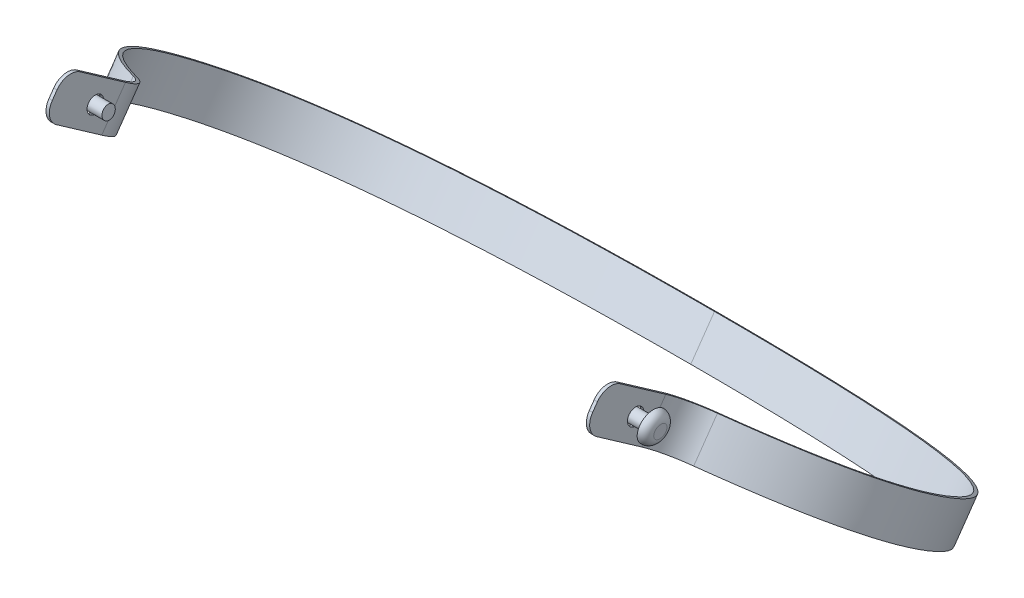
ISO-10303-21;
HEADER;
FILE_DESCRIPTION(('STEP AP214'),'2;1');
FILE_NAME('part.step','',(''),(''),'','','');
FILE_SCHEMA(('AUTOMOTIVE_DESIGN { 1 0 10303 214 1 1 1 1 }'));
ENDSEC;
DATA;
#1=APPLICATION_CONTEXT('core data for automotive mechanical design processes');
#2=APPLICATION_PROTOCOL_DEFINITION('international standard','automotive_design',2000,#1);
#3=PRODUCT_CONTEXT('',#1,'mechanical');
#4=PRODUCT('Part','Part','',(#3));
#5=PRODUCT_RELATED_PRODUCT_CATEGORY('part','',(#4));
#6=PRODUCT_DEFINITION_FORMATION('','',#4);
#7=PRODUCT_DEFINITION_CONTEXT('part definition',#1,'design');
#8=PRODUCT_DEFINITION('design','',#6,#7);
#9=PRODUCT_DEFINITION_SHAPE('','',#8);
#10=(LENGTH_UNIT() NAMED_UNIT(*) SI_UNIT(.MILLI.,.METRE.));
#11=(NAMED_UNIT(*) PLANE_ANGLE_UNIT() SI_UNIT($,.RADIAN.));
#12=(NAMED_UNIT(*) SI_UNIT($,.STERADIAN.) SOLID_ANGLE_UNIT());
#13=UNCERTAINTY_MEASURE_WITH_UNIT(LENGTH_MEASURE(1.E-05),#10,'distance_accuracy_value','');
#14=(GEOMETRIC_REPRESENTATION_CONTEXT(3) GLOBAL_UNCERTAINTY_ASSIGNED_CONTEXT((#13)) GLOBAL_UNIT_ASSIGNED_CONTEXT((#10,
#11,#12)) REPRESENTATION_CONTEXT('',''));
#15=CARTESIAN_POINT('',(0.,0.,0.));
#16=DIRECTION('',(0.,0.,1.));
#17=DIRECTION('',(1.,0.,0.));
#18=AXIS2_PLACEMENT_3D('',#15,#16,#17);
#19=CARTESIAN_POINT('',(174.256885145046,280.076106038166,0.));
#20=DIRECTION('',(0.996194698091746,-0.0871557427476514,0.));
#21=DIRECTION('',(0.0871557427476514,0.996194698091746,0.));
#22=AXIS2_PLACEMENT_3D('',#19,#20,#21);
#23=CIRCLE('',#22,4.);
#24=DIRECTION('',(-1.,0.,0.));
#25=VECTOR('',#24,1.);
#26=SURFACE_OF_LINEAR_EXTRUSION('',#23,#25);
#27=CARTESIAN_POINT('',(174.605508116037,284.060884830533,0.));
#28=VERTEX_POINT('',#27);
#29=EDGE_CURVE('E53',#28,#28,#23,.T.);
#30=ORIENTED_EDGE('',*,*,#29,.F.);
#31=EDGE_LOOP('',(#30));
#32=FACE_BOUND('',#31,.T.);
#33=CARTESIAN_POINT('',(154.256885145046,280.076106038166,0.));
#34=DIRECTION('',(0.996194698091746,-0.0871557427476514,0.));
#35=DIRECTION('',(0.0871557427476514,0.996194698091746,0.));
#36=AXIS2_PLACEMENT_3D('',#33,#34,#35);
#37=CIRCLE('',#36,4.);
#38=CARTESIAN_POINT('',(154.605508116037,284.060884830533,0.));
#39=VERTEX_POINT('',#38);
#40=EDGE_CURVE('E57',#39,#39,#37,.T.);
#41=ORIENTED_EDGE('',*,*,#40,.T.);
#42=EDGE_LOOP('',(#41));
#43=FACE_BOUND('',#42,.T.);
#44=ADVANCED_FACE('F46',(#32,#43),#26,.F.);
#45=CARTESIAN_POINT('',(154.256885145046,280.076106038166,0.));
#46=DIRECTION('',(0.996194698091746,-0.0871557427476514,0.));
#47=DIRECTION('',(0.0871557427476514,0.996194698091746,0.));
#48=AXIS2_PLACEMENT_3D('',#45,#46,#47);
#49=PLANE('',#48);
#50=ORIENTED_EDGE('',*,*,#40,.F.);
#51=EDGE_LOOP('',(#50));
#52=FACE_BOUND('',#51,.T.);
#53=ADVANCED_FACE('F67',(#52),#49,.F.);
#54=CARTESIAN_POINT('',(179.237858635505,279.640327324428,0.));
#55=DIRECTION('',(0.996194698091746,-0.0871557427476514,0.));
#56=DIRECTION('',(0.0871557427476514,0.996194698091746,0.));
#57=AXIS2_PLACEMENT_3D('',#54,#55,#56);
#58=PLANE('',#57);
#59=CARTESIAN_POINT('',(179.237858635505,279.640327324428,0.));
#60=DIRECTION('',(0.996194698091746,-0.0871557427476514,0.));
#61=DIRECTION('',(0.0871557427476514,0.996194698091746,0.));
#62=AXIS2_PLACEMENT_3D('',#59,#60,#61);
#63=CIRCLE('',#62,3.99999999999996);
#64=CARTESIAN_POINT('',(179.586481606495,283.625106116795,0.));
#65=VERTEX_POINT('',#64);
#66=EDGE_CURVE('E11',#65,#65,#63,.T.);
#67=ORIENTED_EDGE('',*,*,#66,.T.);
#68=EDGE_LOOP('',(#67));
#69=FACE_BOUND('',#68,.T.);
#70=ADVANCED_FACE('F71',(#69),#58,.T.);
#71=CARTESIAN_POINT('',(174.256885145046,280.076106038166,0.));
#72=DIRECTION('',(0.996194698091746,-0.0871557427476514,0.));
#73=DIRECTION('',(0.0871557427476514,0.996194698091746,0.));
#74=AXIS2_PLACEMENT_3D('',#71,#72,#73);
#75=PLANE('',#74);
#76=ORIENTED_EDGE('',*,*,#29,.T.);
#77=EDGE_LOOP('',(#76));
#78=FACE_BOUND('',#77,.T.);
#79=CARTESIAN_POINT('',(174.256885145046,280.076106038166,0.));
#80=DIRECTION('',(0.996194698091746,-0.0871557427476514,0.));
#81=DIRECTION('',(0.0871557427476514,0.996194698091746,0.));
#82=AXIS2_PLACEMENT_3D('',#79,#80,#81);
#83=CIRCLE('',#82,8.99999999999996);
#84=CARTESIAN_POINT('',(175.041286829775,289.041858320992,0.));
#85=VERTEX_POINT('',#84);
#86=EDGE_CURVE('E62',#85,#85,#83,.T.);
#87=ORIENTED_EDGE('',*,*,#86,.F.);
#88=EDGE_LOOP('',(#87));
#89=FACE_BOUND('',#88,.T.);
#90=ADVANCED_FACE('F73',(#78,#89),#75,.F.);
#91=CARTESIAN_POINT('',(174.256885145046,280.076106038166,0.));
#92=DIRECTION('',(0.996194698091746,-0.0871557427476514,0.));
#93=DIRECTION('',(0.0871557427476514,0.996194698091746,0.));
#94=AXIS2_PLACEMENT_3D('',#91,#92,#93);
#95=DEGENERATE_TOROIDAL_SURFACE('',#94,3.99999999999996,5.,.T.);
#96=ORIENTED_EDGE('',*,*,#86,.T.);
#97=EDGE_LOOP('',(#96));
#98=FACE_BOUND('',#97,.T.);
#99=ORIENTED_EDGE('',*,*,#66,.F.);
#100=EDGE_LOOP('',(#99));
#101=FACE_BOUND('',#100,.T.);
#102=ADVANCED_FACE('F48',(#98,#101),#95,.T.);
#103=CLOSED_SHELL('',(#44,#53,#70,#90,#102));
#104=MANIFOLD_SOLID_BREP('B2',#103);
#105=CARTESIAN_POINT('',(-162.312329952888,307.52279968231,17.4048558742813));
#106=DIRECTION('',(0.,0.573576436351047,0.819152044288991));
#107=DIRECTION('',(1.,0.,0.));
#108=AXIS2_PLACEMENT_3D('',#105,#106,#107);
#109=PLANE('',#108);
#110=DIRECTION('',(0.,-0.819152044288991,0.573576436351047));
#111=VECTOR('',#110,1.);
#112=CARTESIAN_POINT('',(-164.312329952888,307.52279968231,17.4048558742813));
#113=LINE('',#112,#111);
#114=CARTESIAN_POINT('',(-164.312329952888,299.33127923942,23.1406202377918));
#115=VERTEX_POINT('',#114);
#116=CARTESIAN_POINT('',(-164.312329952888,295.235519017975,26.0085024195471));
#117=VERTEX_POINT('',#116);
#118=EDGE_CURVE('E393',#115,#117,#113,.T.);
#119=ORIENTED_EDGE('',*,*,#118,.T.);
#120=DIRECTION('',(-1.,0.,0.));
#121=VECTOR('',#120,1.);
#122=CARTESIAN_POINT('',(-162.312329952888,295.235519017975,26.0085024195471));
#123=LINE('',#122,#121);
#124=CARTESIAN_POINT('',(-162.312329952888,295.235519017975,26.0085024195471));
#125=VERTEX_POINT('',#124);
#126=EDGE_CURVE('E416',#117,#125,#123,.F.);
#127=ORIENTED_EDGE('',*,*,#126,.T.);
#128=DIRECTION('',(0.,-0.819152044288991,0.573576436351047));
#129=VECTOR('',#128,1.);
#130=CARTESIAN_POINT('',(-162.312329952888,307.52279968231,17.4048558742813));
#131=LINE('',#130,#129);
#132=CARTESIAN_POINT('',(-162.312329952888,299.33127923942,23.1406202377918));
#133=VERTEX_POINT('',#132);
#134=EDGE_CURVE('E273',#133,#125,#131,.T.);
#135=ORIENTED_EDGE('',*,*,#134,.F.);
#136=DIRECTION('',(-1.,0.,0.));
#137=VECTOR('',#136,1.);
#138=CARTESIAN_POINT('',(-164.312329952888,299.33127923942,23.1406202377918));
#139=LINE('',#138,#137);
#140=EDGE_CURVE('E413',#133,#115,#139,.T.);
#141=ORIENTED_EDGE('',*,*,#140,.T.);
#142=EDGE_LOOP('',(#119,#127,#135,#141));
#143=FACE_BOUND('',#142,.T.);
#144=ADVANCED_FACE('F125',(#143),#109,.T.);
#145=CARTESIAN_POINT('',(-162.312329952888,290.315506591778,-7.16970545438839));
#146=DIRECTION('',(1.,0.,0.));
#147=DIRECTION('',(0.,-0.573576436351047,-0.819152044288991));
#148=AXIS2_PLACEMENT_3D('',#145,#146,#147);
#149=PLANE('',#148);
#150=CARTESIAN_POINT('',(-162.312329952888,277.208223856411,-4.09576022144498));
#151=CARTESIAN_POINT('',(-162.312329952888,277.478390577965,-4.28493299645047));
#152=CARTESIAN_POINT('',(-162.312329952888,277.76313401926,-4.44462388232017));
#153=CARTESIAN_POINT('',(-162.312329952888,278.360860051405,-4.70689105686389));
#154=CARTESIAN_POINT('',(-162.312329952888,278.676912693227,-4.80970414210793));
#155=CARTESIAN_POINT('',(-162.312329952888,279.313988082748,-4.94935199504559));
#156=CARTESIAN_POINT('',(-162.312329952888,279.636939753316,-4.98764255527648));
#157=CARTESIAN_POINT('',(-162.312329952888,280.128062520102,-4.99724756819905));
#158=CARTESIAN_POINT('',(-162.312329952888,280.293569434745,-4.99229793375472));
#159=CARTESIAN_POINT('',(-162.312329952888,280.619971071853,-4.96636243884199));
#160=CARTESIAN_POINT('',(-162.312329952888,280.781582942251,-4.945455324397));
#161=CARTESIAN_POINT('',(-162.312329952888,281.261752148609,-4.85941773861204));
#162=CARTESIAN_POINT('',(-162.312329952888,281.576451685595,-4.77089953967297));
#163=CARTESIAN_POINT('',(-162.312329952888,282.189794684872,-4.53060018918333));
#164=CARTESIAN_POINT('',(-162.312329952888,282.479856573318,-4.3823539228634));
#165=CARTESIAN_POINT('',(-162.312329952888,283.028013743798,-4.0317871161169));
#166=CARTESIAN_POINT('',(-162.312329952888,283.28864412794,-3.82675215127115));
#167=CARTESIAN_POINT('',(-162.312329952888,283.760331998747,-3.37391963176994));
#168=CARTESIAN_POINT('',(-162.312329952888,283.971820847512,-3.12697592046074));
#169=CARTESIAN_POINT('',(-162.312329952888,284.346334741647,-2.5922412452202));
#170=CARTESIAN_POINT('',(-162.312329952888,284.509308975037,-2.3027608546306));
#171=CARTESIAN_POINT('',(-162.312329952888,284.771835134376,-1.70695738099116));
#172=CARTESIAN_POINT('',(-162.312329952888,284.873706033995,-1.39788523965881));
#173=CARTESIAN_POINT('',(-162.312329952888,285.017002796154,-0.756769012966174));
#174=CARTESIAN_POINT('',(-162.312329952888,285.056690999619,-0.430311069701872));
#175=CARTESIAN_POINT('',(-162.312329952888,285.07224456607,0.219685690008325));
#176=CARTESIAN_POINT('',(-162.312329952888,285.048174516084,0.547969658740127));
#177=CARTESIAN_POINT('',(-162.312329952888,284.935526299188,1.19488932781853));
#178=CARTESIAN_POINT('',(-162.312329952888,284.848379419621,1.50837766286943));
#179=CARTESIAN_POINT('',(-162.312329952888,284.613861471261,2.11587115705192));
#180=CARTESIAN_POINT('',(-162.312329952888,284.464296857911,2.41265869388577));
#181=CARTESIAN_POINT('',(-162.312329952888,284.114478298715,2.96357229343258));
#182=CARTESIAN_POINT('',(-162.312329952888,283.914196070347,3.2196909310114));
#183=CARTESIAN_POINT('',(-162.312329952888,283.575387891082,3.57461362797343));
#184=CARTESIAN_POINT('',(-162.312329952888,283.45530776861,3.68855247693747));
#185=CARTESIAN_POINT('',(-162.312329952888,283.206604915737,3.90209588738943));
#186=CARTESIAN_POINT('',(-162.312329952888,283.077774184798,4.00205399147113));
#187=CARTESIAN_POINT('',(-162.312329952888,282.678152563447,4.28195674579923));
#188=CARTESIAN_POINT('',(-162.312329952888,282.394361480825,4.44212642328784));
#189=CARTESIAN_POINT('',(-162.312329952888,281.790582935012,4.70740640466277));
#190=CARTESIAN_POINT('',(-162.312329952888,281.480465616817,4.80815145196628));
#191=CARTESIAN_POINT('',(-162.312329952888,281.004023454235,4.91321266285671));
#192=CARTESIAN_POINT('',(-162.312329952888,280.843285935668,4.94051354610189));
#193=CARTESIAN_POINT('',(-162.312329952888,280.517878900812,4.97933486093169));
#194=CARTESIAN_POINT('',(-162.312329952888,280.352723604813,4.9907788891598));
#195=CARTESIAN_POINT('',(-162.312329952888,279.862007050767,5.00050347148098));
#196=CARTESIAN_POINT('',(-162.312329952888,279.537830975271,4.97500500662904));
#197=CARTESIAN_POINT('',(-162.312329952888,278.895354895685,4.86069706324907));
#198=CARTESIAN_POINT('',(-162.312329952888,278.575476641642,4.77055469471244));
#199=CARTESIAN_POINT('',(-162.312329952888,277.968892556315,4.53336837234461));
#200=CARTESIAN_POINT('',(-162.312329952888,277.678723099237,4.38608197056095));
#201=CARTESIAN_POINT('',(-162.312329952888,277.125238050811,4.03279174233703));
#202=CARTESIAN_POINT('',(-162.312329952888,276.866592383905,3.82914350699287));
#203=CARTESIAN_POINT('',(-162.312329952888,276.39700928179,3.37934715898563));
#204=CARTESIAN_POINT('',(-162.312329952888,276.182602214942,3.12994209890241));
#205=CARTESIAN_POINT('',(-162.312329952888,275.805578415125,2.59200416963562));
#206=CARTESIAN_POINT('',(-162.312329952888,275.6458724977,2.30845887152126));
#207=CARTESIAN_POINT('',(-162.312329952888,275.382577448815,1.71297219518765));
#208=CARTESIAN_POINT('',(-162.312329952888,275.278523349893,1.39746417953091));
#209=CARTESIAN_POINT('',(-162.312329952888,275.135918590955,0.760438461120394));
#210=CARTESIAN_POINT('',(-162.312329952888,275.096072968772,0.437785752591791));
#211=CARTESIAN_POINT('',(-162.312329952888,275.079692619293,-0.215851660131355));
#212=CARTESIAN_POINT('',(-162.312329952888,275.104089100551,-0.546592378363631));
#213=CARTESIAN_POINT('',(-162.312329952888,275.215136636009,-1.18764378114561));
#214=CARTESIAN_POINT('',(-162.312329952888,275.301488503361,-1.50168538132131));
#215=CARTESIAN_POINT('',(-162.312329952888,275.538275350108,-2.11628992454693));
#216=CARTESIAN_POINT('',(-162.312329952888,275.685591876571,-2.40824828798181));
#217=CARTESIAN_POINT('',(-162.312329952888,276.033515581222,-2.9576667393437));
#218=CARTESIAN_POINT('',(-162.312329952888,276.236570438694,-3.2180803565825));
#219=CARTESIAN_POINT('',(-162.312329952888,276.689818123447,-3.69307778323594));
#220=CARTESIAN_POINT('',(-162.312329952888,276.938057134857,-3.90658744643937));
#221=CARTESIAN_POINT('',(-162.312329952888,277.208223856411,-4.09576022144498));
#222=B_SPLINE_CURVE_WITH_KNOTS('',3,(#150,#151,#152,#153,#154,#155,#156,#157,#158,#159,#160,
#161,#162,#163,#164,#165,#166,#167,#168,#169,#170,#171,#172,#173,#174,#175,#176,#177,#178,#179,
#180,#181,#182,#183,#184,#185,#186,#187,#188,#189,#190,#191,#192,#193,#194,#195,#196,#197,#198,
#199,#200,#201,#202,#203,#204,#205,#206,#207,#208,#209,#210,#211,#212,#213,#214,#215,#216,#217,
#218,#219,#220,#221),.UNSPECIFIED.,.T.,.F.,(4,2,2,2,2,2,2,2,2,2,2,2,2,2,2,2,2,2,2,2,2,2,2,2,2,2,
2,2,2,2,2,2,2,2,2,4),(0.,0.0312499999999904,0.0624999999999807,0.0937499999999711,
0.109374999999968,0.124999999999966,0.156249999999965,0.187499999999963,0.218749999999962,
0.24999999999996,0.281249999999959,0.312499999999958,0.343749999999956,0.374999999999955,
0.406249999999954,0.437499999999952,0.468749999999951,0.484374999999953,0.499999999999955,
0.531249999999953,0.562499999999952,0.578124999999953,0.593749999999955,0.624999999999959,
0.656249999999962,0.687499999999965,0.718749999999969,0.749999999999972,0.781249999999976,
0.812499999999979,0.843749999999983,0.874999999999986,0.90624999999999,0.937499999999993,
0.968749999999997,1.),.UNSPECIFIED.);
#223=CARTESIAN_POINT('',(-162.312329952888,277.208223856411,-4.09576022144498));
#224=VERTEX_POINT('',#223);
#225=EDGE_CURVE('E463',#224,#224,#222,.T.);
#226=ORIENTED_EDGE('',*,*,#225,.F.);
#227=EDGE_LOOP('',(#226));
#228=FACE_BOUND('',#227,.T.);
#229=ORIENTED_EDGE('',*,*,#134,.T.);
#230=CARTESIAN_POINT('',(-162.312329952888,289.499754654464,17.8169819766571));
#231=DIRECTION('',(1.,0.,0.));
#232=DIRECTION('',(0.,-0.573576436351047,-0.819152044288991));
#233=AXIS2_PLACEMENT_3D('',#230,#231,#232);
#234=CIRCLE('',#233,10.);
#235=CARTESIAN_POINT('',(-162.312329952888,281.308234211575,23.5527463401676));
#236=VERTEX_POINT('',#235);
#237=EDGE_CURVE('E420',#125,#236,#234,.T.);
#238=ORIENTED_EDGE('',*,*,#237,.T.);
#239=DIRECTION('',(0.,0.573576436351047,0.819152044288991));
#240=VECTOR('',#239,1.);
#241=CARTESIAN_POINT('',(-162.312329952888,269.836705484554,7.1697054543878));
#242=LINE('',#241,#240);
#243=CARTESIAN_POINT('',(-162.312329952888,262.098596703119,-3.88145917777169));
#244=VERTEX_POINT('',#243);
#245=EDGE_CURVE('E269',#244,#236,#242,.T.);
#246=ORIENTED_EDGE('',*,*,#245,.F.);
#247=DIRECTION('',(0.,-0.819152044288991,0.573576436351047));
#248=VECTOR('',#247,1.);
#249=CARTESIAN_POINT('',(-162.312329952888,282.577397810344,-18.2208700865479));
#250=LINE('',#249,#248);
#251=CARTESIAN_POINT('',(-162.312329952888,282.577397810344,-18.2208700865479));
#252=VERTEX_POINT('',#251);
#253=EDGE_CURVE('E265',#252,#244,#250,.T.);
#254=ORIENTED_EDGE('',*,*,#253,.F.);
#255=DIRECTION('',(0.,0.573576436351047,0.819152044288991));
#256=VECTOR('',#255,1.);
#257=CARTESIAN_POINT('',(-162.312329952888,290.315506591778,-7.16970545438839));
#258=LINE('',#257,#256);
#259=CARTESIAN_POINT('',(-162.312329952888,301.787035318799,9.21333543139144));
#260=VERTEX_POINT('',#259);
#261=EDGE_CURVE('E250',#252,#260,#258,.T.);
#262=ORIENTED_EDGE('',*,*,#261,.T.);
#263=CARTESIAN_POINT('',(-162.312329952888,293.595514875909,14.9490997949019));
#264=DIRECTION('',(1.,0.,0.));
#265=DIRECTION('',(0.,-0.573576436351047,-0.819152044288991));
#266=AXIS2_PLACEMENT_3D('',#263,#264,#265);
#267=CIRCLE('',#266,10.);
#268=EDGE_CURVE('E418',#260,#133,#267,.T.);
#269=ORIENTED_EDGE('',*,*,#268,.T.);
#270=EDGE_LOOP('',(#229,#238,#246,#254,#262,#269));
#271=FACE_BOUND('',#270,.T.);
#272=ADVANCED_FACE('F267',(#228,#271),#149,.T.);
#273=CARTESIAN_POINT('',(-192.312329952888,282.577397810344,-18.2208700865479));
#274=DIRECTION('',(0.,-0.819152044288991,0.573576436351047));
#275=DIRECTION('',(0.,-0.573576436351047,-0.819152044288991));
#276=AXIS2_PLACEMENT_3D('',#273,#274,#275);
#277=CYLINDRICAL_SURFACE('',#276,30.);
#278=CARTESIAN_POINT('',(-192.312329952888,262.098596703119,-3.88145917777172));
#279=DIRECTION('',(0.,-0.819152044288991,0.573576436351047));
#280=DIRECTION('',(0.,0.573576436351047,0.819152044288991));
#281=AXIS2_PLACEMENT_3D('',#278,#279,#280);
#282=CIRCLE('',#281,30.);
#283=CARTESIAN_POINT('',(-175.423013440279,247.877243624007,-24.1916562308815));
#284=VERTEX_POINT('',#283);
#285=EDGE_CURVE('E457',#284,#244,#282,.T.);
#286=ORIENTED_EDGE('',*,*,#285,.F.);
#287=DIRECTION('',(0.,-0.819152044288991,0.573576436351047));
#288=VECTOR('',#287,1.);
#289=CARTESIAN_POINT('',(-175.423013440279,268.356044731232,-38.5310671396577));
#290=LINE('',#289,#288);
#291=CARTESIAN_POINT('',(-175.423013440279,268.356044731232,-38.5310671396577));
#292=VERTEX_POINT('',#291);
#293=EDGE_CURVE('E274',#292,#284,#290,.T.);
#294=ORIENTED_EDGE('',*,*,#293,.F.);
#295=CARTESIAN_POINT('',(-192.312329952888,282.577397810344,-18.2208700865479));
#296=DIRECTION('',(0.,-0.819152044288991,0.573576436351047));
#297=DIRECTION('',(0.,0.573576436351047,0.819152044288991));
#298=AXIS2_PLACEMENT_3D('',#295,#296,#297);
#299=CIRCLE('',#298,30.);
#300=EDGE_CURVE('E256',#292,#252,#299,.T.);
#301=ORIENTED_EDGE('',*,*,#300,.T.);
#302=ORIENTED_EDGE('',*,*,#253,.T.);
#303=EDGE_LOOP('',(#286,#294,#301,#302));
#304=FACE_BOUND('',#303,.T.);
#305=ADVANCED_FACE('F276',(#304),#277,.T.);
#306=CARTESIAN_POINT('',(0.,146.921397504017,-211.957716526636));
#307=CARTESIAN_POINT('',(-151.105508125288,146.921397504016,-211.957716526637));
#308=CARTESIAN_POINT('',(-224.346396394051,175.786199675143,-170.734506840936));
#309=CARTESIAN_POINT('',(-232.723501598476,232.216294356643,-90.1439796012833));
#310=CARTESIAN_POINT('',(-212.459463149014,253.885559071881,-59.1970623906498));
#311=CARTESIAN_POINT('',(-175.423013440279,268.356044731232,-38.5310671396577));
#312=B_SPLINE_CURVE_WITH_KNOTS('',3,(#306,#307,#308,#309,#310,#311),.UNSPECIFIED.,.F.,.F.,(4,1,
1,4),(0.0275441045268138,0.653421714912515,0.750667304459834,1.),.UNSPECIFIED.);
#313=DIRECTION('',(0.,-0.819152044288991,0.573576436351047));
#314=VECTOR('',#313,1.);
#315=SURFACE_OF_LINEAR_EXTRUSION('',#312,#314);
#316=CARTESIAN_POINT('',(0.,126.442596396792,-197.61830561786));
#317=CARTESIAN_POINT('',(-151.105508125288,126.442596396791,-197.61830561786));
#318=CARTESIAN_POINT('',(-224.346396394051,155.307398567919,-156.39509593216));
#319=CARTESIAN_POINT('',(-232.723501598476,211.737493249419,-75.8045686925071));
#320=CARTESIAN_POINT('',(-212.459463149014,233.406757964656,-44.8576514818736));
#321=CARTESIAN_POINT('',(-175.423013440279,247.877243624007,-24.1916562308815));
#322=B_SPLINE_CURVE_WITH_KNOTS('',3,(#316,#317,#318,#319,#320,#321),.UNSPECIFIED.,.F.,.F.,(4,1,
1,4),(0.0275441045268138,0.653421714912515,0.750667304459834,1.),.UNSPECIFIED.);
#323=CARTESIAN_POINT('',(0.,126.442596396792,-197.61830561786));
#324=VERTEX_POINT('',#323);
#325=EDGE_CURVE('E446',#324,#284,#322,.T.);
#326=ORIENTED_EDGE('',*,*,#325,.F.);
#327=DIRECTION('',(0.,-0.819152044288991,0.573576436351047));
#328=VECTOR('',#327,1.);
#329=CARTESIAN_POINT('',(0.,146.921397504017,-211.957716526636));
#330=LINE('',#329,#328);
#331=CARTESIAN_POINT('',(0.,146.921397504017,-211.957716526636));
#332=VERTEX_POINT('',#331);
#333=EDGE_CURVE('E389',#332,#324,#330,.T.);
#334=ORIENTED_EDGE('',*,*,#333,.F.);
#335=EDGE_CURVE('E277',#332,#292,#312,.T.);
#336=ORIENTED_EDGE('',*,*,#335,.T.);
#337=ORIENTED_EDGE('',*,*,#293,.T.);
#338=EDGE_LOOP('',(#326,#334,#336,#337));
#339=FACE_BOUND('',#338,.T.);
#340=ADVANCED_FACE('F294',(#339),#315,.T.);
#341=CARTESIAN_POINT('',(175.423013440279,268.356044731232,-38.5310671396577));
#342=CARTESIAN_POINT('',(212.459463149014,253.885559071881,-59.1970623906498));
#343=CARTESIAN_POINT('',(232.723501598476,232.216294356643,-90.1439796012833));
#344=CARTESIAN_POINT('',(224.346396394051,175.786199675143,-170.734506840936));
#345=CARTESIAN_POINT('',(151.105508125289,146.921397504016,-211.957716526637));
#346=CARTESIAN_POINT('',(0.,146.921397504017,-211.957716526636));
#347=B_SPLINE_CURVE_WITH_KNOTS('',3,(#341,#342,#343,#344,#345,#346),.UNSPECIFIED.,.F.,.F.,(4,1,
1,4),(0.0275441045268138,0.27687680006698,0.374122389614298,1.),.UNSPECIFIED.);
#348=DIRECTION('',(0.,-0.819152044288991,0.573576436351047));
#349=VECTOR('',#348,1.);
#350=SURFACE_OF_LINEAR_EXTRUSION('',#347,#349);
#351=CARTESIAN_POINT('',(175.423013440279,247.877243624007,-24.1916562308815));
#352=CARTESIAN_POINT('',(212.459463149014,233.406757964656,-44.8576514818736));
#353=CARTESIAN_POINT('',(232.723501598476,211.737493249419,-75.8045686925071));
#354=CARTESIAN_POINT('',(224.346396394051,155.307398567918,-156.39509593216));
#355=CARTESIAN_POINT('',(151.105508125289,126.442596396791,-197.61830561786));
#356=CARTESIAN_POINT('',(0.,126.442596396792,-197.61830561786));
#357=B_SPLINE_CURVE_WITH_KNOTS('',3,(#351,#352,#353,#354,#355,#356),.UNSPECIFIED.,.F.,.F.,(4,1,
1,4),(0.0275441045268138,0.27687680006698,0.374122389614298,1.),.UNSPECIFIED.);
#358=CARTESIAN_POINT('',(175.423013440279,247.877243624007,-24.1916562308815));
#359=VERTEX_POINT('',#358);
#360=EDGE_CURVE('E444',#359,#324,#357,.T.);
#361=ORIENTED_EDGE('',*,*,#360,.F.);
#362=DIRECTION('',(0.,-0.819152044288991,0.573576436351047));
#363=VECTOR('',#362,1.);
#364=CARTESIAN_POINT('',(175.423013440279,268.356044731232,-38.5310671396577));
#365=LINE('',#364,#363);
#366=CARTESIAN_POINT('',(175.423013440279,268.356044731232,-38.5310671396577));
#367=VERTEX_POINT('',#366);
#368=EDGE_CURVE('E387',#367,#359,#365,.T.);
#369=ORIENTED_EDGE('',*,*,#368,.F.);
#370=EDGE_CURVE('E279',#367,#332,#347,.T.);
#371=ORIENTED_EDGE('',*,*,#370,.T.);
#372=ORIENTED_EDGE('',*,*,#333,.T.);
#373=EDGE_LOOP('',(#361,#369,#371,#372));
#374=FACE_BOUND('',#373,.T.);
#375=ADVANCED_FACE('F298',(#374),#350,.T.);
#376=CARTESIAN_POINT('',(192.312329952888,282.577397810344,-18.2208700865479));
#377=DIRECTION('',(0.,-0.819152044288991,0.573576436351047));
#378=DIRECTION('',(0.,-0.573576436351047,-0.819152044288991));
#379=AXIS2_PLACEMENT_3D('',#376,#377,#378);
#380=CYLINDRICAL_SURFACE('',#379,30.);
#381=CARTESIAN_POINT('',(192.312329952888,262.098596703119,-3.88145917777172));
#382=DIRECTION('',(0.,-0.819152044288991,0.573576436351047));
#383=DIRECTION('',(0.,-0.573576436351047,-0.819152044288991));
#384=AXIS2_PLACEMENT_3D('',#381,#382,#383);
#385=CIRCLE('',#384,30.);
#386=CARTESIAN_POINT('',(162.312329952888,262.098596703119,-3.88145917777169));
#387=VERTEX_POINT('',#386);
#388=EDGE_CURVE('E344',#387,#359,#385,.T.);
#389=ORIENTED_EDGE('',*,*,#388,.F.);
#390=DIRECTION('',(0.,-0.819152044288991,0.573576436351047));
#391=VECTOR('',#390,1.);
#392=CARTESIAN_POINT('',(162.312329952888,282.577397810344,-18.2208700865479));
#393=LINE('',#392,#391);
#394=CARTESIAN_POINT('',(162.312329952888,282.577397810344,-18.2208700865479));
#395=VERTEX_POINT('',#394);
#396=EDGE_CURVE('E384',#395,#387,#393,.T.);
#397=ORIENTED_EDGE('',*,*,#396,.F.);
#398=CARTESIAN_POINT('',(192.312329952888,282.577397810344,-18.2208700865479));
#399=DIRECTION('',(0.,-0.819152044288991,0.573576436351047));
#400=DIRECTION('',(0.,-0.573576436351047,-0.819152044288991));
#401=AXIS2_PLACEMENT_3D('',#398,#399,#400);
#402=CIRCLE('',#401,30.);
#403=EDGE_CURVE('E586',#395,#367,#402,.T.);
#404=ORIENTED_EDGE('',*,*,#403,.T.);
#405=ORIENTED_EDGE('',*,*,#368,.T.);
#406=EDGE_LOOP('',(#389,#397,#404,#405));
#407=FACE_BOUND('',#406,.T.);
#408=ADVANCED_FACE('F501',(#407),#380,.T.);
#409=CARTESIAN_POINT('',(162.312329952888,290.315506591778,-7.16970545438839));
#410=DIRECTION('',(-1.,0.,0.));
#411=DIRECTION('',(0.,0.573576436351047,0.819152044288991));
#412=AXIS2_PLACEMENT_3D('',#409,#410,#411);
#413=PLANE('',#412);
#414=CARTESIAN_POINT('',(162.312329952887,277.208223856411,-4.09576022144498));
#415=CARTESIAN_POINT('',(162.312329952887,277.478390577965,-4.28493299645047));
#416=CARTESIAN_POINT('',(162.312329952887,277.76313401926,-4.44462388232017));
#417=CARTESIAN_POINT('',(162.312329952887,278.360860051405,-4.70689105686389));
#418=CARTESIAN_POINT('',(162.312329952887,278.676912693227,-4.80970414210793));
#419=CARTESIAN_POINT('',(162.312329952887,279.313988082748,-4.94935199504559));
#420=CARTESIAN_POINT('',(162.312329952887,279.636939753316,-4.98764255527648));
#421=CARTESIAN_POINT('',(162.312329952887,280.128062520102,-4.99724756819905));
#422=CARTESIAN_POINT('',(162.312329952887,280.293569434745,-4.99229793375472));
#423=CARTESIAN_POINT('',(162.312329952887,280.619971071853,-4.96636243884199));
#424=CARTESIAN_POINT('',(162.312329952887,280.781582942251,-4.945455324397));
#425=CARTESIAN_POINT('',(162.312329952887,281.261752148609,-4.85941773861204));
#426=CARTESIAN_POINT('',(162.312329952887,281.576451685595,-4.77089953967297));
#427=CARTESIAN_POINT('',(162.312329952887,282.189794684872,-4.53060018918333));
#428=CARTESIAN_POINT('',(162.312329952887,282.479856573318,-4.3823539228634));
#429=CARTESIAN_POINT('',(162.312329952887,283.028013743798,-4.0317871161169));
#430=CARTESIAN_POINT('',(162.312329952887,283.28864412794,-3.82675215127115));
#431=CARTESIAN_POINT('',(162.312329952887,283.760331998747,-3.37391963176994));
#432=CARTESIAN_POINT('',(162.312329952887,283.971820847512,-3.12697592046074));
#433=CARTESIAN_POINT('',(162.312329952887,284.346334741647,-2.5922412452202));
#434=CARTESIAN_POINT('',(162.312329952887,284.509308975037,-2.3027608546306));
#435=CARTESIAN_POINT('',(162.312329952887,284.771835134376,-1.70695738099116));
#436=CARTESIAN_POINT('',(162.312329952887,284.873706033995,-1.39788523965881));
#437=CARTESIAN_POINT('',(162.312329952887,285.017002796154,-0.756769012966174));
#438=CARTESIAN_POINT('',(162.312329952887,285.056690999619,-0.430311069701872));
#439=CARTESIAN_POINT('',(162.312329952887,285.07224456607,0.219685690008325));
#440=CARTESIAN_POINT('',(162.312329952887,285.048174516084,0.547969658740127));
#441=CARTESIAN_POINT('',(162.312329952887,284.935526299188,1.19488932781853));
#442=CARTESIAN_POINT('',(162.312329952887,284.848379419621,1.50837766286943));
#443=CARTESIAN_POINT('',(162.312329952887,284.613861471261,2.11587115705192));
#444=CARTESIAN_POINT('',(162.312329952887,284.464296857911,2.41265869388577));
#445=CARTESIAN_POINT('',(162.312329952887,284.114478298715,2.96357229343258));
#446=CARTESIAN_POINT('',(162.312329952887,283.914196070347,3.2196909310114));
#447=CARTESIAN_POINT('',(162.312329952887,283.575387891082,3.57461362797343));
#448=CARTESIAN_POINT('',(162.312329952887,283.45530776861,3.68855247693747));
#449=CARTESIAN_POINT('',(162.312329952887,283.206604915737,3.90209588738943));
#450=CARTESIAN_POINT('',(162.312329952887,283.077774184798,4.00205399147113));
#451=CARTESIAN_POINT('',(162.312329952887,282.678152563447,4.28195674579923));
#452=CARTESIAN_POINT('',(162.312329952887,282.394361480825,4.44212642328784));
#453=CARTESIAN_POINT('',(162.312329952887,281.790582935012,4.70740640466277));
#454=CARTESIAN_POINT('',(162.312329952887,281.480465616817,4.80815145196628));
#455=CARTESIAN_POINT('',(162.312329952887,281.004023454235,4.91321266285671));
#456=CARTESIAN_POINT('',(162.312329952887,280.843285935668,4.94051354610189));
#457=CARTESIAN_POINT('',(162.312329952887,280.517878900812,4.97933486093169));
#458=CARTESIAN_POINT('',(162.312329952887,280.352723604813,4.9907788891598));
#459=CARTESIAN_POINT('',(162.312329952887,279.862007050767,5.00050347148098));
#460=CARTESIAN_POINT('',(162.312329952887,279.537830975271,4.97500500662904));
#461=CARTESIAN_POINT('',(162.312329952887,278.895354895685,4.86069706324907));
#462=CARTESIAN_POINT('',(162.312329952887,278.575476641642,4.77055469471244));
#463=CARTESIAN_POINT('',(162.312329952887,277.968892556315,4.53336837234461));
#464=CARTESIAN_POINT('',(162.312329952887,277.678723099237,4.38608197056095));
#465=CARTESIAN_POINT('',(162.312329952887,277.125238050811,4.03279174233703));
#466=CARTESIAN_POINT('',(162.312329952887,276.866592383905,3.82914350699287));
#467=CARTESIAN_POINT('',(162.312329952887,276.39700928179,3.37934715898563));
#468=CARTESIAN_POINT('',(162.312329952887,276.182602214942,3.12994209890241));
#469=CARTESIAN_POINT('',(162.312329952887,275.805578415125,2.59200416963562));
#470=CARTESIAN_POINT('',(162.312329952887,275.6458724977,2.30845887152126));
#471=CARTESIAN_POINT('',(162.312329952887,275.382577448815,1.71297219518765));
#472=CARTESIAN_POINT('',(162.312329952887,275.278523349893,1.39746417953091));
#473=CARTESIAN_POINT('',(162.312329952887,275.135918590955,0.760438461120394));
#474=CARTESIAN_POINT('',(162.312329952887,275.096072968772,0.437785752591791));
#475=CARTESIAN_POINT('',(162.312329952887,275.079692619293,-0.215851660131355));
#476=CARTESIAN_POINT('',(162.312329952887,275.104089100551,-0.546592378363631));
#477=CARTESIAN_POINT('',(162.312329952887,275.215136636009,-1.18764378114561));
#478=CARTESIAN_POINT('',(162.312329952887,275.301488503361,-1.50168538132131));
#479=CARTESIAN_POINT('',(162.312329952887,275.538275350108,-2.11628992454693));
#480=CARTESIAN_POINT('',(162.312329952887,275.685591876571,-2.40824828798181));
#481=CARTESIAN_POINT('',(162.312329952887,276.033515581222,-2.9576667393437));
#482=CARTESIAN_POINT('',(162.312329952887,276.236570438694,-3.2180803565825));
#483=CARTESIAN_POINT('',(162.312329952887,276.689818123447,-3.69307778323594));
#484=CARTESIAN_POINT('',(162.312329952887,276.938057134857,-3.90658744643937));
#485=CARTESIAN_POINT('',(162.312329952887,277.208223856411,-4.09576022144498));
#486=B_SPLINE_CURVE_WITH_KNOTS('',3,(#414,#415,#416,#417,#418,#419,#420,#421,#422,#423,#424,
#425,#426,#427,#428,#429,#430,#431,#432,#433,#434,#435,#436,#437,#438,#439,#440,#441,#442,#443,
#444,#445,#446,#447,#448,#449,#450,#451,#452,#453,#454,#455,#456,#457,#458,#459,#460,#461,#462,
#463,#464,#465,#466,#467,#468,#469,#470,#471,#472,#473,#474,#475,#476,#477,#478,#479,#480,#481,
#482,#483,#484,#485),.UNSPECIFIED.,.T.,.F.,(4,2,2,2,2,2,2,2,2,2,2,2,2,2,2,2,2,2,2,2,2,2,2,2,2,2,
2,2,2,2,2,2,2,2,2,4),(0.,0.0312499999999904,0.0624999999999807,0.0937499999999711,
0.109374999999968,0.124999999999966,0.156249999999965,0.187499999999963,0.218749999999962,
0.24999999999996,0.281249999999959,0.312499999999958,0.343749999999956,0.374999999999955,
0.406249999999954,0.437499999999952,0.468749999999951,0.484374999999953,0.499999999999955,
0.531249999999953,0.562499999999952,0.578124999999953,0.593749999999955,0.624999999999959,
0.656249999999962,0.687499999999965,0.718749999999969,0.749999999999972,0.781249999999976,
0.812499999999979,0.843749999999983,0.874999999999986,0.90624999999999,0.937499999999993,
0.968749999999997,1.),.UNSPECIFIED.);
#487=CARTESIAN_POINT('',(162.312329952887,277.208223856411,-4.09576022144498));
#488=VERTEX_POINT('',#487);
#489=EDGE_CURVE('E529',#488,#488,#486,.F.);
#490=ORIENTED_EDGE('',*,*,#489,.F.);
#491=EDGE_LOOP('',(#490));
#492=FACE_BOUND('',#491,.T.);
#493=DIRECTION('',(0.,-0.573576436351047,-0.819152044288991));
#494=VECTOR('',#493,1.);
#495=CARTESIAN_POINT('',(162.312329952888,269.836705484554,7.1697054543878));
#496=LINE('',#495,#494);
#497=CARTESIAN_POINT('',(162.312329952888,281.308234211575,23.5527463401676));
#498=VERTEX_POINT('',#497);
#499=EDGE_CURVE('E340',#498,#387,#496,.T.);
#500=ORIENTED_EDGE('',*,*,#499,.F.);
#501=CARTESIAN_POINT('',(162.312329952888,289.499754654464,17.8169819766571));
#502=DIRECTION('',(-1.,0.,0.));
#503=DIRECTION('',(0.,0.573576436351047,0.819152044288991));
#504=AXIS2_PLACEMENT_3D('',#501,#502,#503);
#505=CIRCLE('',#504,10.);
#506=CARTESIAN_POINT('',(162.312329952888,295.235519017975,26.0085024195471));
#507=VERTEX_POINT('',#506);
#508=EDGE_CURVE('E427',#498,#507,#505,.T.);
#509=ORIENTED_EDGE('',*,*,#508,.T.);
#510=DIRECTION('',(0.,-0.819152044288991,0.573576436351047));
#511=VECTOR('',#510,1.);
#512=CARTESIAN_POINT('',(162.312329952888,307.52279968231,17.4048558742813));
#513=LINE('',#512,#511);
#514=CARTESIAN_POINT('',(162.312329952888,299.33127923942,23.1406202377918));
#515=VERTEX_POINT('',#514);
#516=EDGE_CURVE('E382',#515,#507,#513,.T.);
#517=ORIENTED_EDGE('',*,*,#516,.F.);
#518=CARTESIAN_POINT('',(162.312329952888,293.595514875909,14.9490997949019));
#519=DIRECTION('',(-1.,0.,0.));
#520=DIRECTION('',(0.,0.573576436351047,0.819152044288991));
#521=AXIS2_PLACEMENT_3D('',#518,#519,#520);
#522=CIRCLE('',#521,10.);
#523=CARTESIAN_POINT('',(162.312329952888,301.787035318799,9.21333543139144));
#524=VERTEX_POINT('',#523);
#525=EDGE_CURVE('E425',#515,#524,#522,.T.);
#526=ORIENTED_EDGE('',*,*,#525,.T.);
#527=DIRECTION('',(0.,-0.573576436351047,-0.819152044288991));
#528=VECTOR('',#527,1.);
#529=CARTESIAN_POINT('',(162.312329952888,290.315506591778,-7.16970545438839));
#530=LINE('',#529,#528);
#531=EDGE_CURVE('E581',#524,#395,#530,.T.);
#532=ORIENTED_EDGE('',*,*,#531,.T.);
#533=ORIENTED_EDGE('',*,*,#396,.T.);
#534=EDGE_LOOP('',(#500,#509,#517,#526,#532,#533));
#535=FACE_BOUND('',#534,.T.);
#536=ADVANCED_FACE('F436',(#492,#535),#413,.T.);
#537=CARTESIAN_POINT('',(164.312329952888,307.52279968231,17.4048558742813));
#538=DIRECTION('',(0.,0.573576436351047,0.819152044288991));
#539=DIRECTION('',(1.,0.,0.));
#540=AXIS2_PLACEMENT_3D('',#537,#538,#539);
#541=PLANE('',#540);
#542=ORIENTED_EDGE('',*,*,#516,.T.);
#543=DIRECTION('',(-1.,0.,0.));
#544=VECTOR('',#543,1.);
#545=CARTESIAN_POINT('',(164.312329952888,295.235519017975,26.0085024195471));
#546=LINE('',#545,#544);
#547=CARTESIAN_POINT('',(164.312329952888,295.235519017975,26.0085024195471));
#548=VERTEX_POINT('',#547);
#549=EDGE_CURVE('E140',#507,#548,#546,.F.);
#550=ORIENTED_EDGE('',*,*,#549,.T.);
#551=DIRECTION('',(0.,-0.819152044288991,0.573576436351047));
#552=VECTOR('',#551,1.);
#553=CARTESIAN_POINT('',(164.312329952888,307.52279968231,17.4048558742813));
#554=LINE('',#553,#552);
#555=CARTESIAN_POINT('',(164.312329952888,299.33127923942,23.1406202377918));
#556=VERTEX_POINT('',#555);
#557=EDGE_CURVE('E333',#556,#548,#554,.T.);
#558=ORIENTED_EDGE('',*,*,#557,.F.);
#559=DIRECTION('',(-1.,0.,0.));
#560=VECTOR('',#559,1.);
#561=CARTESIAN_POINT('',(162.312329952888,299.33127923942,23.1406202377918));
#562=LINE('',#561,#560);
#563=EDGE_CURVE('E429',#556,#515,#562,.T.);
#564=ORIENTED_EDGE('',*,*,#563,.T.);
#565=EDGE_LOOP('',(#542,#550,#558,#564));
#566=FACE_BOUND('',#565,.T.);
#567=ADVANCED_FACE('F434',(#566),#541,.T.);
#568=CARTESIAN_POINT('',(164.312329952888,290.315506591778,-7.16970545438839));
#569=DIRECTION('',(-1.,0.,0.));
#570=DIRECTION('',(0.,0.573576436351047,0.819152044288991));
#571=AXIS2_PLACEMENT_3D('',#568,#569,#570);
#572=PLANE('',#571);
#573=CARTESIAN_POINT('',(164.312329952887,277.208223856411,-4.09576022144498));
#574=CARTESIAN_POINT('',(164.312329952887,277.478390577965,-4.28493299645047));
#575=CARTESIAN_POINT('',(164.312329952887,277.76313401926,-4.44462388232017));
#576=CARTESIAN_POINT('',(164.312329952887,278.360860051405,-4.70689105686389));
#577=CARTESIAN_POINT('',(164.312329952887,278.676912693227,-4.80970414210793));
#578=CARTESIAN_POINT('',(164.312329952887,279.313988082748,-4.94935199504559));
#579=CARTESIAN_POINT('',(164.312329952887,279.636939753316,-4.98764255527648));
#580=CARTESIAN_POINT('',(164.312329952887,280.128062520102,-4.99724756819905));
#581=CARTESIAN_POINT('',(164.312329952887,280.293569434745,-4.99229793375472));
#582=CARTESIAN_POINT('',(164.312329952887,280.619971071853,-4.96636243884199));
#583=CARTESIAN_POINT('',(164.312329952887,280.781582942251,-4.945455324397));
#584=CARTESIAN_POINT('',(164.312329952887,281.261752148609,-4.85941773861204));
#585=CARTESIAN_POINT('',(164.312329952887,281.576451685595,-4.77089953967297));
#586=CARTESIAN_POINT('',(164.312329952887,282.189794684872,-4.53060018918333));
#587=CARTESIAN_POINT('',(164.312329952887,282.479856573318,-4.3823539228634));
#588=CARTESIAN_POINT('',(164.312329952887,283.028013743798,-4.0317871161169));
#589=CARTESIAN_POINT('',(164.312329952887,283.28864412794,-3.82675215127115));
#590=CARTESIAN_POINT('',(164.312329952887,283.760331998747,-3.37391963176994));
#591=CARTESIAN_POINT('',(164.312329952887,283.971820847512,-3.12697592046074));
#592=CARTESIAN_POINT('',(164.312329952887,284.346334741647,-2.5922412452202));
#593=CARTESIAN_POINT('',(164.312329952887,284.509308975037,-2.3027608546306));
#594=CARTESIAN_POINT('',(164.312329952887,284.771835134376,-1.70695738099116));
#595=CARTESIAN_POINT('',(164.312329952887,284.873706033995,-1.39788523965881));
#596=CARTESIAN_POINT('',(164.312329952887,285.017002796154,-0.756769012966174));
#597=CARTESIAN_POINT('',(164.312329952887,285.056690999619,-0.430311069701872));
#598=CARTESIAN_POINT('',(164.312329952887,285.07224456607,0.219685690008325));
#599=CARTESIAN_POINT('',(164.312329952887,285.048174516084,0.547969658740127));
#600=CARTESIAN_POINT('',(164.312329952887,284.935526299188,1.19488932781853));
#601=CARTESIAN_POINT('',(164.312329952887,284.848379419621,1.50837766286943));
#602=CARTESIAN_POINT('',(164.312329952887,284.613861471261,2.11587115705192));
#603=CARTESIAN_POINT('',(164.312329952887,284.464296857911,2.41265869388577));
#604=CARTESIAN_POINT('',(164.312329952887,284.114478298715,2.96357229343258));
#605=CARTESIAN_POINT('',(164.312329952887,283.914196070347,3.2196909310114));
#606=CARTESIAN_POINT('',(164.312329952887,283.575387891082,3.57461362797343));
#607=CARTESIAN_POINT('',(164.312329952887,283.45530776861,3.68855247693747));
#608=CARTESIAN_POINT('',(164.312329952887,283.206604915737,3.90209588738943));
#609=CARTESIAN_POINT('',(164.312329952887,283.077774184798,4.00205399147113));
#610=CARTESIAN_POINT('',(164.312329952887,282.678152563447,4.28195674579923));
#611=CARTESIAN_POINT('',(164.312329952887,282.394361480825,4.44212642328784));
#612=CARTESIAN_POINT('',(164.312329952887,281.790582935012,4.70740640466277));
#613=CARTESIAN_POINT('',(164.312329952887,281.480465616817,4.80815145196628));
#614=CARTESIAN_POINT('',(164.312329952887,281.004023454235,4.91321266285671));
#615=CARTESIAN_POINT('',(164.312329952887,280.843285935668,4.94051354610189));
#616=CARTESIAN_POINT('',(164.312329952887,280.517878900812,4.97933486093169));
#617=CARTESIAN_POINT('',(164.312329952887,280.352723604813,4.9907788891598));
#618=CARTESIAN_POINT('',(164.312329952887,279.862007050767,5.00050347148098));
#619=CARTESIAN_POINT('',(164.312329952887,279.537830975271,4.97500500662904));
#620=CARTESIAN_POINT('',(164.312329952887,278.895354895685,4.86069706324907));
#621=CARTESIAN_POINT('',(164.312329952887,278.575476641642,4.77055469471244));
#622=CARTESIAN_POINT('',(164.312329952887,277.968892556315,4.53336837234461));
#623=CARTESIAN_POINT('',(164.312329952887,277.678723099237,4.38608197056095));
#624=CARTESIAN_POINT('',(164.312329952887,277.125238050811,4.03279174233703));
#625=CARTESIAN_POINT('',(164.312329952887,276.866592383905,3.82914350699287));
#626=CARTESIAN_POINT('',(164.312329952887,276.39700928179,3.37934715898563));
#627=CARTESIAN_POINT('',(164.312329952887,276.182602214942,3.12994209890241));
#628=CARTESIAN_POINT('',(164.312329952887,275.805578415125,2.59200416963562));
#629=CARTESIAN_POINT('',(164.312329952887,275.6458724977,2.30845887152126));
#630=CARTESIAN_POINT('',(164.312329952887,275.382577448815,1.71297219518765));
#631=CARTESIAN_POINT('',(164.312329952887,275.278523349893,1.39746417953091));
#632=CARTESIAN_POINT('',(164.312329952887,275.135918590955,0.760438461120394));
#633=CARTESIAN_POINT('',(164.312329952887,275.096072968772,0.437785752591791));
#634=CARTESIAN_POINT('',(164.312329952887,275.079692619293,-0.215851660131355));
#635=CARTESIAN_POINT('',(164.312329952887,275.104089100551,-0.546592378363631));
#636=CARTESIAN_POINT('',(164.312329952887,275.215136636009,-1.18764378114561));
#637=CARTESIAN_POINT('',(164.312329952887,275.301488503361,-1.50168538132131));
#638=CARTESIAN_POINT('',(164.312329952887,275.538275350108,-2.11628992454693));
#639=CARTESIAN_POINT('',(164.312329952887,275.685591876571,-2.40824828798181));
#640=CARTESIAN_POINT('',(164.312329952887,276.033515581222,-2.9576667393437));
#641=CARTESIAN_POINT('',(164.312329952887,276.236570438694,-3.2180803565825));
#642=CARTESIAN_POINT('',(164.312329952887,276.689818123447,-3.69307778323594));
#643=CARTESIAN_POINT('',(164.312329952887,276.938057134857,-3.90658744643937));
#644=CARTESIAN_POINT('',(164.312329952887,277.208223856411,-4.09576022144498));
#645=B_SPLINE_CURVE_WITH_KNOTS('',3,(#573,#574,#575,#576,#577,#578,#579,#580,#581,#582,#583,
#584,#585,#586,#587,#588,#589,#590,#591,#592,#593,#594,#595,#596,#597,#598,#599,#600,#601,#602,
#603,#604,#605,#606,#607,#608,#609,#610,#611,#612,#613,#614,#615,#616,#617,#618,#619,#620,#621,
#622,#623,#624,#625,#626,#627,#628,#629,#630,#631,#632,#633,#634,#635,#636,#637,#638,#639,#640,
#641,#642,#643,#644),.UNSPECIFIED.,.T.,.F.,(4,2,2,2,2,2,2,2,2,2,2,2,2,2,2,2,2,2,2,2,2,2,2,2,2,2,
2,2,2,2,2,2,2,2,2,4),(0.,0.0312499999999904,0.0624999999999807,0.0937499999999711,
0.109374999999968,0.124999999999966,0.156249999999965,0.187499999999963,0.218749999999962,
0.24999999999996,0.281249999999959,0.312499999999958,0.343749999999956,0.374999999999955,
0.406249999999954,0.437499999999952,0.468749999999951,0.484374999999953,0.499999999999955,
0.531249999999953,0.562499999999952,0.578124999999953,0.593749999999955,0.624999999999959,
0.656249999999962,0.687499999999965,0.718749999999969,0.749999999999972,0.781249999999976,
0.812499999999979,0.843749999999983,0.874999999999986,0.90624999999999,0.937499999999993,
0.968749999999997,1.),.UNSPECIFIED.);
#646=CARTESIAN_POINT('',(164.312329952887,277.208223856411,-4.09576022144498));
#647=VERTEX_POINT('',#646);
#648=EDGE_CURVE('E401',#647,#647,#645,.F.);
#649=ORIENTED_EDGE('',*,*,#648,.T.);
#650=EDGE_LOOP('',(#649));
#651=FACE_BOUND('',#650,.T.);
#652=ORIENTED_EDGE('',*,*,#557,.T.);
#653=CARTESIAN_POINT('',(164.312329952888,289.499754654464,17.8169819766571));
#654=DIRECTION('',(-1.,0.,0.));
#655=DIRECTION('',(0.,0.573576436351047,0.819152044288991));
#656=AXIS2_PLACEMENT_3D('',#653,#654,#655);
#657=CIRCLE('',#656,10.);
#658=CARTESIAN_POINT('',(164.312329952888,281.308234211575,23.5527463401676));
#659=VERTEX_POINT('',#658);
#660=EDGE_CURVE('E44',#548,#659,#657,.F.);
#661=ORIENTED_EDGE('',*,*,#660,.T.);
#662=DIRECTION('',(0.,-0.573576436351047,-0.819152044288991));
#663=VECTOR('',#662,1.);
#664=CARTESIAN_POINT('',(164.312329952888,269.836705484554,7.1697054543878));
#665=LINE('',#664,#663);
#666=CARTESIAN_POINT('',(164.312329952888,262.098596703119,-3.88145917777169));
#667=VERTEX_POINT('',#666);
#668=EDGE_CURVE('E331',#659,#667,#665,.T.);
#669=ORIENTED_EDGE('',*,*,#668,.T.);
#670=DIRECTION('',(0.,-0.819152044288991,0.573576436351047));
#671=VECTOR('',#670,1.);
#672=CARTESIAN_POINT('',(164.312329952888,282.577397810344,-18.2208700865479));
#673=LINE('',#672,#671);
#674=CARTESIAN_POINT('',(164.312329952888,282.577397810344,-18.2208700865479));
#675=VERTEX_POINT('',#674);
#676=EDGE_CURVE('E379',#675,#667,#673,.T.);
#677=ORIENTED_EDGE('',*,*,#676,.F.);
#678=DIRECTION('',(0.,-0.573576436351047,-0.819152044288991));
#679=VECTOR('',#678,1.);
#680=CARTESIAN_POINT('',(164.312329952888,290.315506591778,-7.16970545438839));
#681=LINE('',#680,#679);
#682=CARTESIAN_POINT('',(164.312329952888,301.787035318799,9.21333543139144));
#683=VERTEX_POINT('',#682);
#684=EDGE_CURVE('E580',#683,#675,#681,.T.);
#685=ORIENTED_EDGE('',*,*,#684,.F.);
#686=CARTESIAN_POINT('',(164.312329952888,293.595514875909,14.9490997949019));
#687=DIRECTION('',(-1.,0.,0.));
#688=DIRECTION('',(0.,0.573576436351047,0.819152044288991));
#689=AXIS2_PLACEMENT_3D('',#686,#687,#688);
#690=CIRCLE('',#689,10.);
#691=EDGE_CURVE('E133',#683,#556,#690,.F.);
#692=ORIENTED_EDGE('',*,*,#691,.T.);
#693=EDGE_LOOP('',(#652,#661,#669,#677,#685,#692));
#694=FACE_BOUND('',#693,.T.);
#695=ADVANCED_FACE('F329',(#651,#694),#572,.F.);
#696=CARTESIAN_POINT('',(192.312329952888,282.577397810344,-18.2208700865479));
#697=DIRECTION('',(0.,-0.819152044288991,0.573576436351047));
#698=DIRECTION('',(0.,-0.573576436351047,-0.819152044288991));
#699=AXIS2_PLACEMENT_3D('',#696,#697,#698);
#700=CYLINDRICAL_SURFACE('',#699,28.);
#701=CARTESIAN_POINT('',(192.312329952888,262.098596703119,-3.88145917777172));
#702=DIRECTION('',(0.,0.819152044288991,-0.573576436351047));
#703=DIRECTION('',(1.,0.,0.));
#704=AXIS2_PLACEMENT_3D('',#701,#702,#703);
#705=CIRCLE('',#704,28.);
#706=CARTESIAN_POINT('',(176.548967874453,248.825333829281,-22.8376430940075));
#707=VERTEX_POINT('',#706);
#708=EDGE_CURVE('E339',#667,#707,#705,.F.);
#709=ORIENTED_EDGE('',*,*,#708,.T.);
#710=DIRECTION('',(0.,-0.819152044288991,0.573576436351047));
#711=VECTOR('',#710,1.);
#712=CARTESIAN_POINT('',(176.548967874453,269.304134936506,-37.1770540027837));
#713=LINE('',#712,#711);
#714=CARTESIAN_POINT('',(176.548967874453,269.304134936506,-37.1770540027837));
#715=VERTEX_POINT('',#714);
#716=EDGE_CURVE('E376',#715,#707,#713,.T.);
#717=ORIENTED_EDGE('',*,*,#716,.F.);
#718=CARTESIAN_POINT('',(192.312329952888,282.577397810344,-18.2208700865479));
#719=DIRECTION('',(0.,0.819152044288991,-0.573576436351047));
#720=DIRECTION('',(1.,0.,0.));
#721=AXIS2_PLACEMENT_3D('',#718,#719,#720);
#722=CIRCLE('',#721,28.);
#723=EDGE_CURVE('E579',#675,#715,#722,.F.);
#724=ORIENTED_EDGE('',*,*,#723,.F.);
#725=ORIENTED_EDGE('',*,*,#676,.T.);
#726=EDGE_LOOP('',(#709,#717,#724,#725));
#727=FACE_BOUND('',#726,.T.);
#728=ADVANCED_FACE('F490',(#727),#700,.F.);
#729=CARTESIAN_POINT('',(176.548967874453,269.304134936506,-37.1770540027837));
#730=CARTESIAN_POINT('',(185.662595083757,265.74335595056,-42.2623734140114));
#731=CARTESIAN_POINT('',(193.447526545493,262.108344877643,-47.4537072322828));
#732=CARTESIAN_POINT('',(206.651737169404,254.74087024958,-57.9755514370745));
#733=CARTESIAN_POINT('',(212.070897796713,251.00818447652,-63.3063791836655));
#734=CARTESIAN_POINT('',(220.826106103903,243.501713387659,-74.0267309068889));
#735=CARTESIAN_POINT('',(224.161568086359,239.727915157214,-79.416273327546));
#736=CARTESIAN_POINT('',(229.032959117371,232.206214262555,-90.1583754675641));
#737=CARTESIAN_POINT('',(230.568607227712,228.458708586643,-95.5103682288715));
#738=CARTESIAN_POINT('',(232.141707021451,221.061403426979,-106.07481484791));
#739=CARTESIAN_POINT('',(232.17960230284,217.411837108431,-111.286935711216));
#740=CARTESIAN_POINT('',(231.350217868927,212.059347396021,-118.931083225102));
#741=CARTESIAN_POINT('',(230.926109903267,210.295417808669,-121.450235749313));
#742=CARTESIAN_POINT('',(229.822217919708,206.815261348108,-126.420414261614));
#743=CARTESIAN_POINT('',(229.14604263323,205.099573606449,-128.870670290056));
#744=CARTESIAN_POINT('',(225.157259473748,196.63612056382,-140.957733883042));
#745=CARTESIAN_POINT('',(219.984153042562,190.244538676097,-150.085858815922));
#746=CARTESIAN_POINT('',(205.143026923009,178.493686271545,-166.867815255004));
#747=CARTESIAN_POINT('',(195.479096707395,173.136491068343,-174.518682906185));
#748=CARTESIAN_POINT('',(171.19401966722,163.693724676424,-188.004350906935));
#749=CARTESIAN_POINT('',(156.574378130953,159.606370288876,-193.841697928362));
#750=CARTESIAN_POINT('',(121.861857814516,152.900870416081,-203.418144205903));
#751=CARTESIAN_POINT('',(101.767560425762,150.28215407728,-207.158058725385));
#752=CARTESIAN_POINT('',(55.5479696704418,146.718772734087,-212.247094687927));
#753=CARTESIAN_POINT('',(29.4221248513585,145.774244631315,-213.596020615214));
#754=CARTESIAN_POINT('',(-1.32210337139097E-13,145.774244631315,-213.596020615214));
#755=B_SPLINE_CURVE_WITH_KNOTS('',3,(#729,#730,#731,#732,#733,#734,#735,#736,#737,#738,#739,
#740,#741,#742,#743,#744,#745,#746,#747,#748,#749,#750,#751,#752,#753,#754),.UNSPECIFIED.,.F.,
.F.,(4,2,2,2,2,2,2,2,2,2,2,2,4),(0.,0.0625000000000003,0.125000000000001,0.187500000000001,
0.250000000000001,0.312500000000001,0.343750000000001,0.375000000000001,0.500000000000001,
0.625000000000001,0.750000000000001,0.875,1.),.UNSPECIFIED.);
#756=DIRECTION('',(0.,-0.819152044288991,0.573576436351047));
#757=VECTOR('',#756,1.);
#758=SURFACE_OF_LINEAR_EXTRUSION('',#755,#757);
#759=CARTESIAN_POINT('',(176.548967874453,248.825333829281,-22.8376430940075));
#760=CARTESIAN_POINT('',(185.662595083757,245.264554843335,-27.9229625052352));
#761=CARTESIAN_POINT('',(193.447526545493,241.629543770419,-33.1142963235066));
#762=CARTESIAN_POINT('',(206.651737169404,234.262069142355,-43.6361405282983));
#763=CARTESIAN_POINT('',(212.070897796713,230.529383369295,-48.9669682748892));
#764=CARTESIAN_POINT('',(220.826106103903,223.022912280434,-59.6873199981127));
#765=CARTESIAN_POINT('',(224.161568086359,219.249114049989,-65.0768624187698));
#766=CARTESIAN_POINT('',(229.032959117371,211.72741315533,-75.8189645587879));
#767=CARTESIAN_POINT('',(230.568607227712,207.979907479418,-81.1709573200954));
#768=CARTESIAN_POINT('',(232.141707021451,200.582602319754,-91.7354039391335));
#769=CARTESIAN_POINT('',(232.17960230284,196.933036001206,-96.9475248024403));
#770=CARTESIAN_POINT('',(231.350217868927,191.580546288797,-104.591672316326));
#771=CARTESIAN_POINT('',(230.926109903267,189.816616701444,-107.110824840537));
#772=CARTESIAN_POINT('',(229.822217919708,186.336460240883,-112.081003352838));
#773=CARTESIAN_POINT('',(229.14604263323,184.620772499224,-114.53125938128));
#774=CARTESIAN_POINT('',(225.157259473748,176.157319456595,-126.618322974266));
#775=CARTESIAN_POINT('',(219.984153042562,169.765737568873,-135.746447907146));
#776=CARTESIAN_POINT('',(205.143026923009,158.01488516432,-152.528404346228));
#777=CARTESIAN_POINT('',(195.479096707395,152.657689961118,-160.179271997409));
#778=CARTESIAN_POINT('',(171.19401966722,143.2149235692,-173.664939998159));
#779=CARTESIAN_POINT('',(156.574378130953,139.127569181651,-179.502287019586));
#780=CARTESIAN_POINT('',(121.861857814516,132.422069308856,-189.078733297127));
#781=CARTESIAN_POINT('',(101.767560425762,129.803352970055,-192.818647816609));
#782=CARTESIAN_POINT('',(55.5479696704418,126.239971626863,-197.907683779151));
#783=CARTESIAN_POINT('',(29.4221248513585,125.29544352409,-199.256609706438));
#784=CARTESIAN_POINT('',(-1.32210337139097E-13,125.29544352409,-199.256609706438));
#785=B_SPLINE_CURVE_WITH_KNOTS('',3,(#759,#760,#761,#762,#763,#764,#765,#766,#767,#768,#769,
#770,#771,#772,#773,#774,#775,#776,#777,#778,#779,#780,#781,#782,#783,#784),.UNSPECIFIED.,.F.,
.F.,(4,2,2,2,2,2,2,2,2,2,2,2,4),(0.,0.0625000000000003,0.125000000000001,0.187500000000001,
0.250000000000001,0.312500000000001,0.343750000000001,0.375000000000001,0.500000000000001,
0.625000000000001,0.750000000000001,0.875,1.),.UNSPECIFIED.);
#786=CARTESIAN_POINT('',(0.,125.29544352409,-199.256609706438));
#787=VERTEX_POINT('',#786);
#788=EDGE_CURVE('E342',#707,#787,#785,.T.);
#789=ORIENTED_EDGE('',*,*,#788,.T.);
#790=DIRECTION('',(0.,-0.819152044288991,0.573576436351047));
#791=VECTOR('',#790,1.);
#792=CARTESIAN_POINT('',(0.,145.774244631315,-213.596020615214));
#793=LINE('',#792,#791);
#794=CARTESIAN_POINT('',(0.,145.774244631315,-213.596020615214));
#795=VERTEX_POINT('',#794);
#796=EDGE_CURVE('E373',#795,#787,#793,.T.);
#797=ORIENTED_EDGE('',*,*,#796,.F.);
#798=EDGE_CURVE('E471',#715,#795,#755,.T.);
#799=ORIENTED_EDGE('',*,*,#798,.F.);
#800=ORIENTED_EDGE('',*,*,#716,.T.);
#801=EDGE_LOOP('',(#789,#797,#799,#800));
#802=FACE_BOUND('',#801,.T.);
#803=ADVANCED_FACE('F485',(#802),#758,.F.);
#804=CARTESIAN_POINT('',(0.,145.774244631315,-213.596020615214));
#805=CARTESIAN_POINT('',(-29.4221248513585,145.774244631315,-213.596020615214));
#806=CARTESIAN_POINT('',(-55.5479696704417,146.718772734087,-212.247094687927));
#807=CARTESIAN_POINT('',(-101.767560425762,150.28215407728,-207.158058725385));
#808=CARTESIAN_POINT('',(-121.861857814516,152.900870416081,-203.418144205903));
#809=CARTESIAN_POINT('',(-156.574378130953,159.606370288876,-193.841697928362));
#810=CARTESIAN_POINT('',(-171.19401966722,163.693724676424,-188.004350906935));
#811=CARTESIAN_POINT('',(-195.479096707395,173.136491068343,-174.518682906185));
#812=CARTESIAN_POINT('',(-205.143026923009,178.493686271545,-166.867815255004));
#813=CARTESIAN_POINT('',(-219.984153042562,190.244538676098,-150.085858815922));
#814=CARTESIAN_POINT('',(-225.157259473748,196.63612056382,-140.957733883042));
#815=CARTESIAN_POINT('',(-229.14604263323,205.099573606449,-128.870670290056));
#816=CARTESIAN_POINT('',(-229.822217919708,206.815261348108,-126.420414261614));
#817=CARTESIAN_POINT('',(-230.926109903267,210.295417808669,-121.450235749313));
#818=CARTESIAN_POINT('',(-231.350217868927,212.059347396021,-118.931083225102));
#819=CARTESIAN_POINT('',(-232.17960230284,217.411837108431,-111.286935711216));
#820=CARTESIAN_POINT('',(-232.141707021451,221.061403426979,-106.07481484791));
#821=CARTESIAN_POINT('',(-230.568607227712,228.458708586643,-95.5103682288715));
#822=CARTESIAN_POINT('',(-229.032959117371,232.206214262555,-90.158375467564));
#823=CARTESIAN_POINT('',(-224.161568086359,239.727915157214,-79.416273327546));
#824=CARTESIAN_POINT('',(-220.826106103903,243.501713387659,-74.0267309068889));
#825=CARTESIAN_POINT('',(-212.070897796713,251.00818447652,-63.3063791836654));
#826=CARTESIAN_POINT('',(-206.651737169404,254.74087024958,-57.9755514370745));
#827=CARTESIAN_POINT('',(-193.447526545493,262.108344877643,-47.4537072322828));
#828=CARTESIAN_POINT('',(-185.662595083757,265.74335595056,-42.2623734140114));
#829=CARTESIAN_POINT('',(-176.548967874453,269.304134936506,-37.1770540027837));
#830=B_SPLINE_CURVE_WITH_KNOTS('',3,(#804,#805,#806,#807,#808,#809,#810,#811,#812,#813,#814,
#815,#816,#817,#818,#819,#820,#821,#822,#823,#824,#825,#826,#827,#828,#829),.UNSPECIFIED.,.F.,
.F.,(4,2,2,2,2,2,2,2,2,2,2,2,4),(0.,0.125,0.25,0.374999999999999,0.499999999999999,
0.624999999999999,0.656249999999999,0.687499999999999,0.749999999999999,0.812499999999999,
0.874999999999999,0.9375,1.),.UNSPECIFIED.);
#831=DIRECTION('',(0.,-0.819152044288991,0.573576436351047));
#832=VECTOR('',#831,1.);
#833=SURFACE_OF_LINEAR_EXTRUSION('',#830,#832);
#834=CARTESIAN_POINT('',(0.,125.29544352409,-199.256609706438));
#835=CARTESIAN_POINT('',(-29.4221248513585,125.29544352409,-199.256609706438));
#836=CARTESIAN_POINT('',(-55.5479696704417,126.239971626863,-197.907683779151));
#837=CARTESIAN_POINT('',(-101.767560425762,129.803352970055,-192.818647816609));
#838=CARTESIAN_POINT('',(-121.861857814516,132.422069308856,-189.078733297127));
#839=CARTESIAN_POINT('',(-156.574378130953,139.127569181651,-179.502287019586));
#840=CARTESIAN_POINT('',(-171.19401966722,143.2149235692,-173.664939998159));
#841=CARTESIAN_POINT('',(-195.479096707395,152.657689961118,-160.179271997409));
#842=CARTESIAN_POINT('',(-205.143026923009,158.01488516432,-152.528404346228));
#843=CARTESIAN_POINT('',(-219.984153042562,169.765737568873,-135.746447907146));
#844=CARTESIAN_POINT('',(-225.157259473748,176.157319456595,-126.618322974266));
#845=CARTESIAN_POINT('',(-229.14604263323,184.620772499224,-114.53125938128));
#846=CARTESIAN_POINT('',(-229.822217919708,186.336460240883,-112.081003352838));
#847=CARTESIAN_POINT('',(-230.926109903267,189.816616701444,-107.110824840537));
#848=CARTESIAN_POINT('',(-231.350217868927,191.580546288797,-104.591672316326));
#849=CARTESIAN_POINT('',(-232.17960230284,196.933036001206,-96.9475248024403));
#850=CARTESIAN_POINT('',(-232.141707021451,200.582602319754,-91.7354039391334));
#851=CARTESIAN_POINT('',(-230.568607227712,207.979907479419,-81.1709573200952));
#852=CARTESIAN_POINT('',(-229.032959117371,211.72741315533,-75.8189645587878));
#853=CARTESIAN_POINT('',(-224.161568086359,219.249114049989,-65.0768624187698));
#854=CARTESIAN_POINT('',(-220.826106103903,223.022912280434,-59.6873199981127));
#855=CARTESIAN_POINT('',(-212.070897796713,230.529383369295,-48.9669682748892));
#856=CARTESIAN_POINT('',(-206.651737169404,234.262069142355,-43.6361405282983));
#857=CARTESIAN_POINT('',(-193.447526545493,241.629543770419,-33.1142963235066));
#858=CARTESIAN_POINT('',(-185.662595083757,245.264554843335,-27.9229625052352));
#859=CARTESIAN_POINT('',(-176.548967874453,248.825333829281,-22.8376430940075));
#860=B_SPLINE_CURVE_WITH_KNOTS('',3,(#834,#835,#836,#837,#838,#839,#840,#841,#842,#843,#844,
#845,#846,#847,#848,#849,#850,#851,#852,#853,#854,#855,#856,#857,#858,#859),.UNSPECIFIED.,.F.,
.F.,(4,2,2,2,2,2,2,2,2,2,2,2,4),(0.,0.125,0.25,0.374999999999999,0.499999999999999,
0.624999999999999,0.656249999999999,0.687499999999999,0.749999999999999,0.812499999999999,
0.874999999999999,0.9375,1.),.UNSPECIFIED.);
#861=CARTESIAN_POINT('',(-176.548967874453,248.825333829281,-22.8376430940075));
#862=VERTEX_POINT('',#861);
#863=EDGE_CURVE('E351',#787,#862,#860,.T.);
#864=ORIENTED_EDGE('',*,*,#863,.T.);
#865=DIRECTION('',(0.,-0.819152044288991,0.573576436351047));
#866=VECTOR('',#865,1.);
#867=CARTESIAN_POINT('',(-176.548967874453,269.304134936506,-37.1770540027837));
#868=LINE('',#867,#866);
#869=CARTESIAN_POINT('',(-176.548967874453,269.304134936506,-37.1770540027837));
#870=VERTEX_POINT('',#869);
#871=EDGE_CURVE('E369',#870,#862,#868,.T.);
#872=ORIENTED_EDGE('',*,*,#871,.F.);
#873=EDGE_CURVE('E466',#795,#870,#830,.T.);
#874=ORIENTED_EDGE('',*,*,#873,.F.);
#875=ORIENTED_EDGE('',*,*,#796,.T.);
#876=EDGE_LOOP('',(#864,#872,#874,#875));
#877=FACE_BOUND('',#876,.T.);
#878=ADVANCED_FACE('F480',(#877),#833,.F.);
#879=CARTESIAN_POINT('',(-192.312329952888,282.577397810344,-18.2208700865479));
#880=DIRECTION('',(0.,-0.819152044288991,0.573576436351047));
#881=DIRECTION('',(0.,-0.573576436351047,-0.819152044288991));
#882=AXIS2_PLACEMENT_3D('',#879,#880,#881);
#883=CYLINDRICAL_SURFACE('',#882,28.);
#884=CARTESIAN_POINT('',(-192.312329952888,262.098596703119,-3.88145917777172));
#885=DIRECTION('',(0.,0.819152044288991,-0.573576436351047));
#886=DIRECTION('',(1.,0.,0.));
#887=AXIS2_PLACEMENT_3D('',#884,#885,#886);
#888=CIRCLE('',#887,28.);
#889=CARTESIAN_POINT('',(-164.312329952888,262.098596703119,-3.88145917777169));
#890=VERTEX_POINT('',#889);
#891=EDGE_CURVE('E358',#862,#890,#888,.F.);
#892=ORIENTED_EDGE('',*,*,#891,.T.);
#893=DIRECTION('',(0.,-0.819152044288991,0.573576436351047));
#894=VECTOR('',#893,1.);
#895=CARTESIAN_POINT('',(-164.312329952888,282.577397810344,-18.2208700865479));
#896=LINE('',#895,#894);
#897=CARTESIAN_POINT('',(-164.312329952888,282.577397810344,-18.2208700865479));
#898=VERTEX_POINT('',#897);
#899=EDGE_CURVE('E366',#898,#890,#896,.T.);
#900=ORIENTED_EDGE('',*,*,#899,.F.);
#901=CARTESIAN_POINT('',(-192.312329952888,282.577397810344,-18.2208700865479));
#902=DIRECTION('',(0.,0.819152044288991,-0.573576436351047));
#903=DIRECTION('',(1.,0.,0.));
#904=AXIS2_PLACEMENT_3D('',#901,#902,#903);
#905=CIRCLE('',#904,28.);
#906=EDGE_CURVE('E370',#870,#898,#905,.F.);
#907=ORIENTED_EDGE('',*,*,#906,.F.);
#908=ORIENTED_EDGE('',*,*,#871,.T.);
#909=EDGE_LOOP('',(#892,#900,#907,#908));
#910=FACE_BOUND('',#909,.T.);
#911=ADVANCED_FACE('F484',(#910),#883,.F.);
#912=CARTESIAN_POINT('',(-164.312329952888,290.315506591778,-7.16970545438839));
#913=DIRECTION('',(1.,0.,0.));
#914=DIRECTION('',(0.,-0.573576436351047,-0.819152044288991));
#915=AXIS2_PLACEMENT_3D('',#912,#913,#914);
#916=PLANE('',#915);
#917=CARTESIAN_POINT('',(-164.312329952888,277.208223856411,-4.09576022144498));
#918=CARTESIAN_POINT('',(-164.312329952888,277.478390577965,-4.28493299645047));
#919=CARTESIAN_POINT('',(-164.312329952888,277.76313401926,-4.44462388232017));
#920=CARTESIAN_POINT('',(-164.312329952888,278.360860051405,-4.70689105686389));
#921=CARTESIAN_POINT('',(-164.312329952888,278.676912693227,-4.80970414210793));
#922=CARTESIAN_POINT('',(-164.312329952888,279.313988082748,-4.94935199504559));
#923=CARTESIAN_POINT('',(-164.312329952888,279.636939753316,-4.98764255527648));
#924=CARTESIAN_POINT('',(-164.312329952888,280.128062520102,-4.99724756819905));
#925=CARTESIAN_POINT('',(-164.312329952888,280.293569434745,-4.99229793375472));
#926=CARTESIAN_POINT('',(-164.312329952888,280.619971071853,-4.96636243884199));
#927=CARTESIAN_POINT('',(-164.312329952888,280.781582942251,-4.945455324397));
#928=CARTESIAN_POINT('',(-164.312329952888,281.261752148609,-4.85941773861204));
#929=CARTESIAN_POINT('',(-164.312329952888,281.576451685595,-4.77089953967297));
#930=CARTESIAN_POINT('',(-164.312329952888,282.189794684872,-4.53060018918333));
#931=CARTESIAN_POINT('',(-164.312329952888,282.479856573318,-4.3823539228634));
#932=CARTESIAN_POINT('',(-164.312329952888,283.028013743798,-4.0317871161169));
#933=CARTESIAN_POINT('',(-164.312329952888,283.28864412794,-3.82675215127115));
#934=CARTESIAN_POINT('',(-164.312329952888,283.760331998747,-3.37391963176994));
#935=CARTESIAN_POINT('',(-164.312329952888,283.971820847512,-3.12697592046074));
#936=CARTESIAN_POINT('',(-164.312329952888,284.346334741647,-2.5922412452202));
#937=CARTESIAN_POINT('',(-164.312329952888,284.509308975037,-2.3027608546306));
#938=CARTESIAN_POINT('',(-164.312329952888,284.771835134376,-1.70695738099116));
#939=CARTESIAN_POINT('',(-164.312329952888,284.873706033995,-1.39788523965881));
#940=CARTESIAN_POINT('',(-164.312329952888,285.017002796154,-0.756769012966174));
#941=CARTESIAN_POINT('',(-164.312329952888,285.056690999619,-0.430311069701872));
#942=CARTESIAN_POINT('',(-164.312329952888,285.07224456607,0.219685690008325));
#943=CARTESIAN_POINT('',(-164.312329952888,285.048174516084,0.547969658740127));
#944=CARTESIAN_POINT('',(-164.312329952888,284.935526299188,1.19488932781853));
#945=CARTESIAN_POINT('',(-164.312329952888,284.848379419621,1.50837766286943));
#946=CARTESIAN_POINT('',(-164.312329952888,284.613861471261,2.11587115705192));
#947=CARTESIAN_POINT('',(-164.312329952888,284.464296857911,2.41265869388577));
#948=CARTESIAN_POINT('',(-164.312329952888,284.114478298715,2.96357229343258));
#949=CARTESIAN_POINT('',(-164.312329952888,283.914196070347,3.2196909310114));
#950=CARTESIAN_POINT('',(-164.312329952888,283.575387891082,3.57461362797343));
#951=CARTESIAN_POINT('',(-164.312329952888,283.45530776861,3.68855247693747));
#952=CARTESIAN_POINT('',(-164.312329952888,283.206604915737,3.90209588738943));
#953=CARTESIAN_POINT('',(-164.312329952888,283.077774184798,4.00205399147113));
#954=CARTESIAN_POINT('',(-164.312329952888,282.678152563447,4.28195674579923));
#955=CARTESIAN_POINT('',(-164.312329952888,282.394361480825,4.44212642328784));
#956=CARTESIAN_POINT('',(-164.312329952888,281.790582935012,4.70740640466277));
#957=CARTESIAN_POINT('',(-164.312329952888,281.480465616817,4.80815145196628));
#958=CARTESIAN_POINT('',(-164.312329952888,281.004023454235,4.91321266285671));
#959=CARTESIAN_POINT('',(-164.312329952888,280.843285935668,4.94051354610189));
#960=CARTESIAN_POINT('',(-164.312329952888,280.517878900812,4.97933486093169));
#961=CARTESIAN_POINT('',(-164.312329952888,280.352723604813,4.9907788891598));
#962=CARTESIAN_POINT('',(-164.312329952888,279.862007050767,5.00050347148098));
#963=CARTESIAN_POINT('',(-164.312329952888,279.537830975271,4.97500500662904));
#964=CARTESIAN_POINT('',(-164.312329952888,278.895354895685,4.86069706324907));
#965=CARTESIAN_POINT('',(-164.312329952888,278.575476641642,4.77055469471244));
#966=CARTESIAN_POINT('',(-164.312329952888,277.968892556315,4.53336837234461));
#967=CARTESIAN_POINT('',(-164.312329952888,277.678723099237,4.38608197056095));
#968=CARTESIAN_POINT('',(-164.312329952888,277.125238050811,4.03279174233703));
#969=CARTESIAN_POINT('',(-164.312329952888,276.866592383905,3.82914350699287));
#970=CARTESIAN_POINT('',(-164.312329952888,276.39700928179,3.37934715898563));
#971=CARTESIAN_POINT('',(-164.312329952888,276.182602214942,3.12994209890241));
#972=CARTESIAN_POINT('',(-164.312329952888,275.805578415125,2.59200416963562));
#973=CARTESIAN_POINT('',(-164.312329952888,275.6458724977,2.30845887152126));
#974=CARTESIAN_POINT('',(-164.312329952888,275.382577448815,1.71297219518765));
#975=CARTESIAN_POINT('',(-164.312329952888,275.278523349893,1.39746417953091));
#976=CARTESIAN_POINT('',(-164.312329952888,275.135918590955,0.760438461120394));
#977=CARTESIAN_POINT('',(-164.312329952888,275.096072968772,0.437785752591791));
#978=CARTESIAN_POINT('',(-164.312329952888,275.079692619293,-0.215851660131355));
#979=CARTESIAN_POINT('',(-164.312329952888,275.104089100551,-0.546592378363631));
#980=CARTESIAN_POINT('',(-164.312329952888,275.215136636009,-1.18764378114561));
#981=CARTESIAN_POINT('',(-164.312329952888,275.301488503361,-1.50168538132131));
#982=CARTESIAN_POINT('',(-164.312329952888,275.538275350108,-2.11628992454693));
#983=CARTESIAN_POINT('',(-164.312329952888,275.685591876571,-2.40824828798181));
#984=CARTESIAN_POINT('',(-164.312329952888,276.033515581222,-2.9576667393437));
#985=CARTESIAN_POINT('',(-164.312329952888,276.236570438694,-3.2180803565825));
#986=CARTESIAN_POINT('',(-164.312329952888,276.689818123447,-3.69307778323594));
#987=CARTESIAN_POINT('',(-164.312329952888,276.938057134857,-3.90658744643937));
#988=CARTESIAN_POINT('',(-164.312329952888,277.208223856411,-4.09576022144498));
#989=B_SPLINE_CURVE_WITH_KNOTS('',3,(#917,#918,#919,#920,#921,#922,#923,#924,#925,#926,#927,
#928,#929,#930,#931,#932,#933,#934,#935,#936,#937,#938,#939,#940,#941,#942,#943,#944,#945,#946,
#947,#948,#949,#950,#951,#952,#953,#954,#955,#956,#957,#958,#959,#960,#961,#962,#963,#964,#965,
#966,#967,#968,#969,#970,#971,#972,#973,#974,#975,#976,#977,#978,#979,#980,#981,#982,#983,#984,
#985,#986,#987,#988),.UNSPECIFIED.,.T.,.F.,(4,2,2,2,2,2,2,2,2,2,2,2,2,2,2,2,2,2,2,2,2,2,2,2,2,2,
2,2,2,2,2,2,2,2,2,4),(0.,0.0312499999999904,0.0624999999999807,0.0937499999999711,
0.109374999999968,0.124999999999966,0.156249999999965,0.187499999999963,0.218749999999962,
0.24999999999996,0.281249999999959,0.312499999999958,0.343749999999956,0.374999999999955,
0.406249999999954,0.437499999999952,0.468749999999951,0.484374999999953,0.499999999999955,
0.531249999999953,0.562499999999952,0.578124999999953,0.593749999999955,0.624999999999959,
0.656249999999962,0.687499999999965,0.718749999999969,0.749999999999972,0.781249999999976,
0.812499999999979,0.843749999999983,0.874999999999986,0.90624999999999,0.937499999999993,
0.968749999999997,1.),.UNSPECIFIED.);
#990=CARTESIAN_POINT('',(-164.312329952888,277.208223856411,-4.09576022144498));
#991=VERTEX_POINT('',#990);
#992=EDGE_CURVE('E396',#991,#991,#989,.T.);
#993=ORIENTED_EDGE('',*,*,#992,.T.);
#994=EDGE_LOOP('',(#993));
#995=FACE_BOUND('',#994,.T.);
#996=DIRECTION('',(0.,-0.573576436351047,-0.819152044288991));
#997=VECTOR('',#996,1.);
#998=CARTESIAN_POINT('',(-164.312329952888,269.836705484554,7.1697054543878));
#999=LINE('',#998,#997);
#1000=CARTESIAN_POINT('',(-164.312329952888,281.308234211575,23.5527463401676));
#1001=VERTEX_POINT('',#1000);
#1002=EDGE_CURVE('E363',#890,#1001,#999,.F.);
#1003=ORIENTED_EDGE('',*,*,#1002,.T.);
#1004=CARTESIAN_POINT('',(-164.312329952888,289.499754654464,17.8169819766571));
#1005=DIRECTION('',(1.,0.,0.));
#1006=DIRECTION('',(0.,-0.573576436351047,-0.819152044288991));
#1007=AXIS2_PLACEMENT_3D('',#1004,#1005,#1006);
#1008=CIRCLE('',#1007,10.);
#1009=EDGE_CURVE('E411',#1001,#117,#1008,.F.);
#1010=ORIENTED_EDGE('',*,*,#1009,.T.);
#1011=ORIENTED_EDGE('',*,*,#118,.F.);
#1012=CARTESIAN_POINT('',(-164.312329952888,293.595514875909,14.9490997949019));
#1013=DIRECTION('',(1.,0.,0.));
#1014=DIRECTION('',(0.,-0.573576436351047,-0.819152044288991));
#1015=AXIS2_PLACEMENT_3D('',#1012,#1013,#1014);
#1016=CIRCLE('',#1015,10.);
#1017=CARTESIAN_POINT('',(-164.312329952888,301.787035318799,9.21333543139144));
#1018=VERTEX_POINT('',#1017);
#1019=EDGE_CURVE('E409',#115,#1018,#1016,.F.);
#1020=ORIENTED_EDGE('',*,*,#1019,.T.);
#1021=DIRECTION('',(0.,-0.573576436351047,-0.819152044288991));
#1022=VECTOR('',#1021,1.);
#1023=CARTESIAN_POINT('',(-164.312329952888,290.315506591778,-7.16970545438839));
#1024=LINE('',#1023,#1022);
#1025=EDGE_CURVE('E262',#898,#1018,#1024,.F.);
#1026=ORIENTED_EDGE('',*,*,#1025,.F.);
#1027=ORIENTED_EDGE('',*,*,#899,.T.);
#1028=EDGE_LOOP('',(#1003,#1010,#1011,#1020,#1026,#1027));
#1029=FACE_BOUND('',#1028,.T.);
#1030=ADVANCED_FACE('F519',(#995,#1029),#916,.F.);
#1031=CARTESIAN_POINT('',(-192.312329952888,282.577397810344,-18.2208700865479));
#1032=DIRECTION('',(0.,-0.819152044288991,0.573576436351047));
#1033=DIRECTION('',(-1.,0.,0.));
#1034=AXIS2_PLACEMENT_3D('',#1031,#1032,#1033);
#1035=PLANE('',#1034);
#1036=ORIENTED_EDGE('',*,*,#1025,.T.);
#1037=DIRECTION('',(-1.,0.,0.));
#1038=VECTOR('',#1037,1.);
#1039=CARTESIAN_POINT('',(-162.312329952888,301.787035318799,9.21333543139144));
#1040=LINE('',#1039,#1038);
#1041=EDGE_CURVE('E259',#1018,#260,#1040,.F.);
#1042=ORIENTED_EDGE('',*,*,#1041,.T.);
#1043=ORIENTED_EDGE('',*,*,#261,.F.);
#1044=ORIENTED_EDGE('',*,*,#300,.F.);
#1045=ORIENTED_EDGE('',*,*,#335,.F.);
#1046=ORIENTED_EDGE('',*,*,#370,.F.);
#1047=ORIENTED_EDGE('',*,*,#403,.F.);
#1048=ORIENTED_EDGE('',*,*,#531,.F.);
#1049=DIRECTION('',(-1.,0.,0.));
#1050=VECTOR('',#1049,1.);
#1051=CARTESIAN_POINT('',(164.312329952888,301.787035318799,9.21333543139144));
#1052=LINE('',#1051,#1050);
#1053=EDGE_CURVE('E422',#524,#683,#1052,.F.);
#1054=ORIENTED_EDGE('',*,*,#1053,.T.);
#1055=ORIENTED_EDGE('',*,*,#684,.T.);
#1056=ORIENTED_EDGE('',*,*,#723,.T.);
#1057=ORIENTED_EDGE('',*,*,#798,.T.);
#1058=ORIENTED_EDGE('',*,*,#873,.T.);
#1059=ORIENTED_EDGE('',*,*,#906,.T.);
#1060=EDGE_LOOP('',(#1036,#1042,#1043,#1044,#1045,#1046,#1047,#1048,#1054,#1055,#1056,#1057,
#1058,#1059));
#1061=FACE_BOUND('',#1060,.T.);
#1062=ADVANCED_FACE('F253',(#1061),#1035,.F.);
#1063=CARTESIAN_POINT('',(-192.312329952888,262.098596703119,-3.88145917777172));
#1064=DIRECTION('',(0.,-0.819152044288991,0.573576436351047));
#1065=DIRECTION('',(-1.,0.,0.));
#1066=AXIS2_PLACEMENT_3D('',#1063,#1064,#1065);
#1067=PLANE('',#1066);
#1068=ORIENTED_EDGE('',*,*,#245,.T.);
#1069=DIRECTION('',(-1.,0.,0.));
#1070=VECTOR('',#1069,1.);
#1071=CARTESIAN_POINT('',(-192.312329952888,281.308234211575,23.5527463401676));
#1072=LINE('',#1071,#1070);
#1073=EDGE_CURVE('E406',#236,#1001,#1072,.T.);
#1074=ORIENTED_EDGE('',*,*,#1073,.T.);
#1075=ORIENTED_EDGE('',*,*,#1002,.F.);
#1076=ORIENTED_EDGE('',*,*,#891,.F.);
#1077=ORIENTED_EDGE('',*,*,#863,.F.);
#1078=ORIENTED_EDGE('',*,*,#788,.F.);
#1079=ORIENTED_EDGE('',*,*,#708,.F.);
#1080=ORIENTED_EDGE('',*,*,#668,.F.);
#1081=DIRECTION('',(-1.,0.,0.));
#1082=VECTOR('',#1081,1.);
#1083=CARTESIAN_POINT('',(-192.312329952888,281.308234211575,23.5527463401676));
#1084=LINE('',#1083,#1082);
#1085=EDGE_CURVE('E327',#659,#498,#1084,.T.);
#1086=ORIENTED_EDGE('',*,*,#1085,.T.);
#1087=ORIENTED_EDGE('',*,*,#499,.T.);
#1088=ORIENTED_EDGE('',*,*,#388,.T.);
#1089=ORIENTED_EDGE('',*,*,#360,.T.);
#1090=ORIENTED_EDGE('',*,*,#325,.T.);
#1091=ORIENTED_EDGE('',*,*,#285,.T.);
#1092=EDGE_LOOP('',(#1068,#1074,#1075,#1076,#1077,#1078,#1079,#1080,#1086,#1087,#1088,#1089,
#1090,#1091));
#1093=FACE_BOUND('',#1092,.T.);
#1094=ADVANCED_FACE('F336',(#1093),#1067,.T.);
#1095=CARTESIAN_POINT('',(-656.740127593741,277.208223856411,-4.09576022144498));
#1096=CARTESIAN_POINT('',(-656.740127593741,277.478390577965,-4.28493299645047));
#1097=CARTESIAN_POINT('',(-656.740127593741,277.76313401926,-4.44462388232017));
#1098=CARTESIAN_POINT('',(-656.740127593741,278.360860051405,-4.70689105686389));
#1099=CARTESIAN_POINT('',(-656.740127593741,278.676912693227,-4.80970414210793));
#1100=CARTESIAN_POINT('',(-656.740127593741,279.313988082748,-4.94935199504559));
#1101=CARTESIAN_POINT('',(-656.740127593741,279.636939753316,-4.98764255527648));
#1102=CARTESIAN_POINT('',(-656.740127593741,280.128062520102,-4.99724756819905));
#1103=CARTESIAN_POINT('',(-656.740127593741,280.293569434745,-4.99229793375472));
#1104=CARTESIAN_POINT('',(-656.740127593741,280.619971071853,-4.96636243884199));
#1105=CARTESIAN_POINT('',(-656.740127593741,280.781582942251,-4.945455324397));
#1106=CARTESIAN_POINT('',(-656.740127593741,281.261752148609,-4.85941773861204));
#1107=CARTESIAN_POINT('',(-656.740127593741,281.576451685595,-4.77089953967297));
#1108=CARTESIAN_POINT('',(-656.740127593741,282.189794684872,-4.53060018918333));
#1109=CARTESIAN_POINT('',(-656.740127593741,282.479856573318,-4.3823539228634));
#1110=CARTESIAN_POINT('',(-656.740127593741,283.028013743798,-4.0317871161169));
#1111=CARTESIAN_POINT('',(-656.740127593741,283.28864412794,-3.82675215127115));
#1112=CARTESIAN_POINT('',(-656.740127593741,283.760331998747,-3.37391963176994));
#1113=CARTESIAN_POINT('',(-656.740127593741,283.971820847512,-3.12697592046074));
#1114=CARTESIAN_POINT('',(-656.740127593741,284.346334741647,-2.5922412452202));
#1115=CARTESIAN_POINT('',(-656.740127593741,284.509308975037,-2.3027608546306));
#1116=CARTESIAN_POINT('',(-656.740127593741,284.771835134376,-1.70695738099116));
#1117=CARTESIAN_POINT('',(-656.740127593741,284.873706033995,-1.39788523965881));
#1118=CARTESIAN_POINT('',(-656.740127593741,285.017002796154,-0.756769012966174));
#1119=CARTESIAN_POINT('',(-656.740127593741,285.056690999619,-0.430311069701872));
#1120=CARTESIAN_POINT('',(-656.740127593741,285.07224456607,0.219685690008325));
#1121=CARTESIAN_POINT('',(-656.740127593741,285.048174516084,0.547969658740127));
#1122=CARTESIAN_POINT('',(-656.740127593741,284.935526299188,1.19488932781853));
#1123=CARTESIAN_POINT('',(-656.740127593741,284.848379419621,1.50837766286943));
#1124=CARTESIAN_POINT('',(-656.740127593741,284.613861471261,2.11587115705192));
#1125=CARTESIAN_POINT('',(-656.740127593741,284.464296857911,2.41265869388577));
#1126=CARTESIAN_POINT('',(-656.740127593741,284.114478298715,2.96357229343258));
#1127=CARTESIAN_POINT('',(-656.740127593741,283.914196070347,3.2196909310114));
#1128=CARTESIAN_POINT('',(-656.740127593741,283.575387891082,3.57461362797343));
#1129=CARTESIAN_POINT('',(-656.740127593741,283.45530776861,3.68855247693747));
#1130=CARTESIAN_POINT('',(-656.740127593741,283.206604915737,3.90209588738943));
#1131=CARTESIAN_POINT('',(-656.740127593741,283.077774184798,4.00205399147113));
#1132=CARTESIAN_POINT('',(-656.740127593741,282.678152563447,4.28195674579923));
#1133=CARTESIAN_POINT('',(-656.740127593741,282.394361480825,4.44212642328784));
#1134=CARTESIAN_POINT('',(-656.740127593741,281.790582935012,4.70740640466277));
#1135=CARTESIAN_POINT('',(-656.740127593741,281.480465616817,4.80815145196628));
#1136=CARTESIAN_POINT('',(-656.740127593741,281.004023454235,4.91321266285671));
#1137=CARTESIAN_POINT('',(-656.740127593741,280.843285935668,4.94051354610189));
#1138=CARTESIAN_POINT('',(-656.740127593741,280.517878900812,4.97933486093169));
#1139=CARTESIAN_POINT('',(-656.740127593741,280.352723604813,4.9907788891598));
#1140=CARTESIAN_POINT('',(-656.740127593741,279.862007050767,5.00050347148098));
#1141=CARTESIAN_POINT('',(-656.740127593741,279.537830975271,4.97500500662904));
#1142=CARTESIAN_POINT('',(-656.740127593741,278.895354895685,4.86069706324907));
#1143=CARTESIAN_POINT('',(-656.740127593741,278.575476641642,4.77055469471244));
#1144=CARTESIAN_POINT('',(-656.740127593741,277.968892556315,4.53336837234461));
#1145=CARTESIAN_POINT('',(-656.740127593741,277.678723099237,4.38608197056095));
#1146=CARTESIAN_POINT('',(-656.740127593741,277.125238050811,4.03279174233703));
#1147=CARTESIAN_POINT('',(-656.740127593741,276.866592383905,3.82914350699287));
#1148=CARTESIAN_POINT('',(-656.740127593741,276.39700928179,3.37934715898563));
#1149=CARTESIAN_POINT('',(-656.740127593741,276.182602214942,3.12994209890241));
#1150=CARTESIAN_POINT('',(-656.740127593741,275.805578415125,2.59200416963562));
#1151=CARTESIAN_POINT('',(-656.740127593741,275.6458724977,2.30845887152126));
#1152=CARTESIAN_POINT('',(-656.740127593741,275.382577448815,1.71297219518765));
#1153=CARTESIAN_POINT('',(-656.740127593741,275.278523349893,1.39746417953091));
#1154=CARTESIAN_POINT('',(-656.740127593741,275.135918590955,0.760438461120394));
#1155=CARTESIAN_POINT('',(-656.740127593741,275.096072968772,0.437785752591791));
#1156=CARTESIAN_POINT('',(-656.740127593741,275.079692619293,-0.215851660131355));
#1157=CARTESIAN_POINT('',(-656.740127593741,275.104089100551,-0.546592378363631));
#1158=CARTESIAN_POINT('',(-656.740127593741,275.215136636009,-1.18764378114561));
#1159=CARTESIAN_POINT('',(-656.740127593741,275.301488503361,-1.50168538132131));
#1160=CARTESIAN_POINT('',(-656.740127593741,275.538275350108,-2.11628992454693));
#1161=CARTESIAN_POINT('',(-656.740127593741,275.685591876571,-2.40824828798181));
#1162=CARTESIAN_POINT('',(-656.740127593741,276.033515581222,-2.9576667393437));
#1163=CARTESIAN_POINT('',(-656.740127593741,276.236570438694,-3.2180803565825));
#1164=CARTESIAN_POINT('',(-656.740127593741,276.689818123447,-3.69307778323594));
#1165=CARTESIAN_POINT('',(-656.740127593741,276.938057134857,-3.90658744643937));
#1166=CARTESIAN_POINT('',(-656.740127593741,277.208223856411,-4.09576022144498));
#1167=B_SPLINE_CURVE_WITH_KNOTS('',3,(#1095,#1096,#1097,#1098,#1099,#1100,#1101,#1102,#1103,
#1104,#1105,#1106,#1107,#1108,#1109,#1110,#1111,#1112,#1113,#1114,#1115,#1116,#1117,#1118,#1119,
#1120,#1121,#1122,#1123,#1124,#1125,#1126,#1127,#1128,#1129,#1130,#1131,#1132,#1133,#1134,#1135,
#1136,#1137,#1138,#1139,#1140,#1141,#1142,#1143,#1144,#1145,#1146,#1147,#1148,#1149,#1150,#1151,
#1152,#1153,#1154,#1155,#1156,#1157,#1158,#1159,#1160,#1161,#1162,#1163,#1164,#1165,#1166),
.UNSPECIFIED.,.T.,.F.,(4,2,2,2,2,2,2,2,2,2,2,2,2,2,2,2,2,2,2,2,2,2,2,2,2,2,2,2,2,2,2,2,2,2,2,4),
(0.,0.0312499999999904,0.0624999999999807,0.0937499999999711,0.109374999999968,
0.124999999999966,0.156249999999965,0.187499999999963,0.218749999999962,0.24999999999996,
0.281249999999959,0.312499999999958,0.343749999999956,0.374999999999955,0.406249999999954,
0.437499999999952,0.468749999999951,0.484374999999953,0.499999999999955,0.531249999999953,
0.562499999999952,0.578124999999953,0.593749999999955,0.624999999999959,0.656249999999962,
0.687499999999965,0.718749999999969,0.749999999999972,0.781249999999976,0.812499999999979,
0.843749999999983,0.874999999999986,0.90624999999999,0.937499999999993,0.968749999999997,1.),.UNSPECIFIED.);
#1168=DIRECTION('',(1.,0.,0.));
#1169=VECTOR('',#1168,1.);
#1170=SURFACE_OF_LINEAR_EXTRUSION('',#1167,#1169);
#1171=ORIENTED_EDGE('',*,*,#225,.T.);
#1172=EDGE_LOOP('',(#1171));
#1173=FACE_BOUND('',#1172,.T.);
#1174=ORIENTED_EDGE('',*,*,#992,.F.);
#1175=EDGE_LOOP('',(#1174));
#1176=FACE_BOUND('',#1175,.T.);
#1177=ADVANCED_FACE('F554',(#1173,#1176),#1170,.F.);
#1178=ORIENTED_EDGE('',*,*,#489,.T.);
#1179=EDGE_LOOP('',(#1178));
#1180=FACE_BOUND('',#1179,.T.);
#1181=ORIENTED_EDGE('',*,*,#648,.F.);
#1182=EDGE_LOOP('',(#1181));
#1183=FACE_BOUND('',#1182,.T.);
#1184=ADVANCED_FACE('F313',(#1180,#1183),#1170,.F.);
#1185=CARTESIAN_POINT('',(-192.312329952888,289.499754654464,17.8169819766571));
#1186=DIRECTION('',(-1.,0.,0.));
#1187=DIRECTION('',(0.,0.573576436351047,0.819152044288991));
#1188=AXIS2_PLACEMENT_3D('',#1185,#1186,#1187);
#1189=CYLINDRICAL_SURFACE('',#1188,10.);
#1190=ORIENTED_EDGE('',*,*,#237,.F.);
#1191=ORIENTED_EDGE('',*,*,#126,.F.);
#1192=ORIENTED_EDGE('',*,*,#1009,.F.);
#1193=ORIENTED_EDGE('',*,*,#1073,.F.);
#1194=EDGE_LOOP('',(#1190,#1191,#1192,#1193));
#1195=FACE_BOUND('',#1194,.T.);
#1196=ADVANCED_FACE('F309',(#1195),#1189,.T.);
#1197=CARTESIAN_POINT('',(-162.312329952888,293.595514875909,14.9490997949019));
#1198=DIRECTION('',(1.,0.,0.));
#1199=DIRECTION('',(0.,-0.573576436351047,-0.819152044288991));
#1200=AXIS2_PLACEMENT_3D('',#1197,#1198,#1199);
#1201=CYLINDRICAL_SURFACE('',#1200,10.);
#1202=ORIENTED_EDGE('',*,*,#268,.F.);
#1203=ORIENTED_EDGE('',*,*,#1041,.F.);
#1204=ORIENTED_EDGE('',*,*,#1019,.F.);
#1205=ORIENTED_EDGE('',*,*,#140,.F.);
#1206=EDGE_LOOP('',(#1202,#1203,#1204,#1205));
#1207=FACE_BOUND('',#1206,.T.);
#1208=ADVANCED_FACE('F312',(#1207),#1201,.T.);
#1209=CARTESIAN_POINT('',(-192.312329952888,289.499754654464,17.8169819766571));
#1210=DIRECTION('',(-1.,0.,0.));
#1211=DIRECTION('',(0.,0.573576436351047,0.819152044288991));
#1212=AXIS2_PLACEMENT_3D('',#1209,#1210,#1211);
#1213=CYLINDRICAL_SURFACE('',#1212,10.);
#1214=ORIENTED_EDGE('',*,*,#660,.F.);
#1215=ORIENTED_EDGE('',*,*,#549,.F.);
#1216=ORIENTED_EDGE('',*,*,#508,.F.);
#1217=ORIENTED_EDGE('',*,*,#1085,.F.);
#1218=EDGE_LOOP('',(#1214,#1215,#1216,#1217));
#1219=FACE_BOUND('',#1218,.T.);
#1220=ADVANCED_FACE('F316',(#1219),#1213,.T.);
#1221=CARTESIAN_POINT('',(164.312329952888,293.595514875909,14.9490997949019));
#1222=DIRECTION('',(1.,0.,0.));
#1223=DIRECTION('',(0.,-0.573576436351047,-0.819152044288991));
#1224=AXIS2_PLACEMENT_3D('',#1221,#1222,#1223);
#1225=CYLINDRICAL_SURFACE('',#1224,10.);
#1226=ORIENTED_EDGE('',*,*,#691,.F.);
#1227=ORIENTED_EDGE('',*,*,#1053,.F.);
#1228=ORIENTED_EDGE('',*,*,#525,.F.);
#1229=ORIENTED_EDGE('',*,*,#563,.F.);
#1230=EDGE_LOOP('',(#1226,#1227,#1228,#1229));
#1231=FACE_BOUND('',#1230,.T.);
#1232=ADVANCED_FACE('F127',(#1231),#1225,.T.);
#1233=CLOSED_SHELL('',(#144,#272,#305,#340,#375,#408,#536,#567,#695,#728,#803,#878,#911,#1030,
#1062,#1094,#1177,#1184,#1196,#1208,#1220,#1232));
#1234=MANIFOLD_SOLID_BREP('B6',#1233);
#1235=CARTESIAN_POINT('',(-174.256885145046,280.076106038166,0.));
#1236=DIRECTION('',(0.996194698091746,0.0871557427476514,0.));
#1237=DIRECTION('',(-0.0871557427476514,0.996194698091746,0.));
#1238=AXIS2_PLACEMENT_3D('',#1235,#1236,#1237);
#1239=CIRCLE('',#1238,4.);
#1240=DIRECTION('',(1.,0.,0.));
#1241=VECTOR('',#1240,1.);
#1242=SURFACE_OF_LINEAR_EXTRUSION('',#1239,#1241);
#1243=CARTESIAN_POINT('',(-174.605508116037,284.060884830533,0.));
#1244=VERTEX_POINT('',#1243);
#1245=EDGE_CURVE('E744',#1244,#1244,#1239,.T.);
#1246=ORIENTED_EDGE('',*,*,#1245,.T.);
#1247=EDGE_LOOP('',(#1246));
#1248=FACE_BOUND('',#1247,.T.);
#1249=CARTESIAN_POINT('',(-154.256885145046,280.076106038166,0.));
#1250=DIRECTION('',(0.996194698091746,0.0871557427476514,0.));
#1251=DIRECTION('',(-0.0871557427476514,0.996194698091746,0.));
#1252=AXIS2_PLACEMENT_3D('',#1249,#1250,#1251);
#1253=CIRCLE('',#1252,4.);
#1254=CARTESIAN_POINT('',(-154.605508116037,284.060884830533,0.));
#1255=VERTEX_POINT('',#1254);
#1256=EDGE_CURVE('E748',#1255,#1255,#1253,.T.);
#1257=ORIENTED_EDGE('',*,*,#1256,.F.);
#1258=EDGE_LOOP('',(#1257));
#1259=FACE_BOUND('',#1258,.T.);
#1260=ADVANCED_FACE('F737',(#1248,#1259),#1242,.T.);
#1261=CARTESIAN_POINT('',(-154.256885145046,280.076106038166,0.));
#1262=DIRECTION('',(-0.996194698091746,-0.0871557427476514,0.));
#1263=DIRECTION('',(-0.0871557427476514,0.996194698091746,0.));
#1264=AXIS2_PLACEMENT_3D('',#1261,#1262,#1263);
#1265=PLANE('',#1264);
#1266=ORIENTED_EDGE('',*,*,#1256,.T.);
#1267=EDGE_LOOP('',(#1266));
#1268=FACE_BOUND('',#1267,.T.);
#1269=ADVANCED_FACE('F758',(#1268),#1265,.F.);
#1270=CARTESIAN_POINT('',(-179.237858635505,279.640327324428,0.));
#1271=DIRECTION('',(-0.996194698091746,-0.0871557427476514,0.));
#1272=DIRECTION('',(-0.0871557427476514,0.996194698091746,0.));
#1273=AXIS2_PLACEMENT_3D('',#1270,#1271,#1272);
#1274=PLANE('',#1273);
#1275=CARTESIAN_POINT('',(-179.237858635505,279.640327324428,0.));
#1276=DIRECTION('',(0.996194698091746,0.0871557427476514,0.));
#1277=DIRECTION('',(-0.0871557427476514,0.996194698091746,0.));
#1278=AXIS2_PLACEMENT_3D('',#1275,#1276,#1277);
#1279=CIRCLE('',#1278,3.99999999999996);
#1280=CARTESIAN_POINT('',(-179.586481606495,283.625106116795,0.));
#1281=VERTEX_POINT('',#1280);
#1282=EDGE_CURVE('E124',#1281,#1281,#1279,.T.);
#1283=ORIENTED_EDGE('',*,*,#1282,.F.);
#1284=EDGE_LOOP('',(#1283));
#1285=FACE_BOUND('',#1284,.T.);
#1286=ADVANCED_FACE('F761',(#1285),#1274,.T.);
#1287=CARTESIAN_POINT('',(-174.256885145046,280.076106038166,0.));
#1288=DIRECTION('',(-0.996194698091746,-0.0871557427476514,0.));
#1289=DIRECTION('',(-0.0871557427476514,0.996194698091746,0.));
#1290=AXIS2_PLACEMENT_3D('',#1287,#1288,#1289);
#1291=PLANE('',#1290);
#1292=ORIENTED_EDGE('',*,*,#1245,.F.);
#1293=EDGE_LOOP('',(#1292));
#1294=FACE_BOUND('',#1293,.T.);
#1295=CARTESIAN_POINT('',(-174.256885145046,280.076106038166,0.));
#1296=DIRECTION('',(0.996194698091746,0.0871557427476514,0.));
#1297=DIRECTION('',(-0.0871557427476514,0.996194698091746,0.));
#1298=AXIS2_PLACEMENT_3D('',#1295,#1296,#1297);
#1299=CIRCLE('',#1298,8.99999999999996);
#1300=CARTESIAN_POINT('',(-175.041286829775,289.041858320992,0.));
#1301=VERTEX_POINT('',#1300);
#1302=EDGE_CURVE('E753',#1301,#1301,#1299,.T.);
#1303=ORIENTED_EDGE('',*,*,#1302,.T.);
#1304=EDGE_LOOP('',(#1303));
#1305=FACE_BOUND('',#1304,.T.);
#1306=ADVANCED_FACE('F763',(#1294,#1305),#1291,.F.);
#1307=CARTESIAN_POINT('',(-174.256885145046,280.076106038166,0.));
#1308=DIRECTION('',(-0.996194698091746,-0.0871557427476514,0.));
#1309=DIRECTION('',(-0.0871557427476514,0.996194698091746,0.));
#1310=AXIS2_PLACEMENT_3D('',#1307,#1308,#1309);
#1311=DEGENERATE_TOROIDAL_SURFACE('',#1310,3.99999999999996,5.,.T.);
#1312=ORIENTED_EDGE('',*,*,#1302,.F.);
#1313=EDGE_LOOP('',(#1312));
#1314=FACE_BOUND('',#1313,.T.);
#1315=ORIENTED_EDGE('',*,*,#1282,.T.);
#1316=EDGE_LOOP('',(#1315));
#1317=FACE_BOUND('',#1316,.T.);
#1318=ADVANCED_FACE('F739',(#1314,#1317),#1311,.T.);
#1319=CLOSED_SHELL('',(#1260,#1269,#1286,#1306,#1318));
#1320=MANIFOLD_SOLID_BREP('B38',#1319);
#1321=ADVANCED_BREP_SHAPE_REPRESENTATION('',(#18,#104,#1234,#1320),#14);
#1322=SHAPE_DEFINITION_REPRESENTATION(#9,#1321);
ENDSEC;
END-ISO-10303-21;
